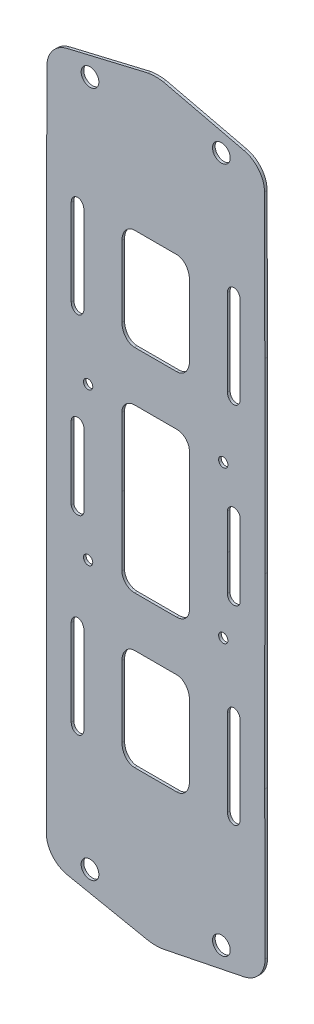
ISO-10303-21;
HEADER;
FILE_DESCRIPTION(('STEP AP214'),'2;1');
FILE_NAME('part.step','',(''),(''),'','','');
FILE_SCHEMA(('AUTOMOTIVE_DESIGN { 1 0 10303 214 1 1 1 1 }'));
ENDSEC;
DATA;
#1=APPLICATION_CONTEXT('core data for automotive mechanical design processes');
#2=APPLICATION_PROTOCOL_DEFINITION('international standard','automotive_design',2000,#1);
#3=PRODUCT_CONTEXT('',#1,'mechanical');
#4=PRODUCT('Part','Part','',(#3));
#5=PRODUCT_RELATED_PRODUCT_CATEGORY('part','',(#4));
#6=PRODUCT_DEFINITION_FORMATION('','',#4);
#7=PRODUCT_DEFINITION_CONTEXT('part definition',#1,'design');
#8=PRODUCT_DEFINITION('design','',#6,#7);
#9=PRODUCT_DEFINITION_SHAPE('','',#8);
#10=(LENGTH_UNIT() NAMED_UNIT(*) SI_UNIT(.MILLI.,.METRE.));
#11=(NAMED_UNIT(*) PLANE_ANGLE_UNIT() SI_UNIT($,.RADIAN.));
#12=(NAMED_UNIT(*) SI_UNIT($,.STERADIAN.) SOLID_ANGLE_UNIT());
#13=UNCERTAINTY_MEASURE_WITH_UNIT(LENGTH_MEASURE(1.E-05),#10,'distance_accuracy_value','');
#14=(GEOMETRIC_REPRESENTATION_CONTEXT(3) GLOBAL_UNCERTAINTY_ASSIGNED_CONTEXT((#13)) GLOBAL_UNIT_ASSIGNED_CONTEXT((#10,
#11,#12)) REPRESENTATION_CONTEXT('',''));
#15=CARTESIAN_POINT('',(0.,0.,0.));
#16=DIRECTION('',(0.,0.,1.));
#17=DIRECTION('',(1.,0.,0.));
#18=AXIS2_PLACEMENT_3D('',#15,#16,#17);
#19=CARTESIAN_POINT('',(15.6008487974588,62.6166574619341,0.5));
#20=DIRECTION('',(0.,0.,1.));
#21=DIRECTION('',(1.,0.,0.));
#22=AXIS2_PLACEMENT_3D('',#19,#20,#21);
#23=PLANE('',#22);
#24=CARTESIAN_POINT('',(-12.4370091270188,64.958952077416,0.5));
#25=DIRECTION('',(0.,0.,1.));
#26=DIRECTION('',(-1.,0.,0.));
#27=AXIS2_PLACEMENT_3D('',#24,#25,#26);
#28=CIRCLE('',#27,1.67999999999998);
#29=CARTESIAN_POINT('',(-14.1170091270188,64.958952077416,0.5));
#30=VERTEX_POINT('',#29);
#31=EDGE_CURVE('E1678',#30,#30,#28,.T.);
#32=ORIENTED_EDGE('',*,*,#31,.F.);
#33=EDGE_LOOP('',(#32));
#34=FACE_BOUND('',#33,.T.);
#35=CARTESIAN_POINT('',(-12.7919999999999,-14.4015625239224,0.5));
#36=DIRECTION('',(0.,0.,1.));
#37=DIRECTION('',(1.,0.,0.));
#38=AXIS2_PLACEMENT_3D('',#35,#36,#37);
#39=CIRCLE('',#38,0.880000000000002);
#40=CARTESIAN_POINT('',(-11.9119999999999,-14.4015625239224,0.5));
#41=VERTEX_POINT('',#40);
#42=EDGE_CURVE('E1690',#41,#41,#39,.T.);
#43=ORIENTED_EDGE('',*,*,#42,.F.);
#44=EDGE_LOOP('',(#43));
#45=FACE_BOUND('',#44,.T.);
#46=DIRECTION('',(0.,-1.,0.));
#47=VECTOR('',#46,1.);
#48=CARTESIAN_POINT('',(-15.9919999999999,42.6106285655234,0.5));
#49=LINE('',#48,#47);
#50=CARTESIAN_POINT('',(-15.9919999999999,42.6106285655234,0.5));
#51=VERTEX_POINT('',#50);
#52=CARTESIAN_POINT('',(-15.9919999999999,26.2906285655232,0.5));
#53=VERTEX_POINT('',#52);
#54=EDGE_CURVE('E527',#51,#53,#49,.T.);
#55=ORIENTED_EDGE('',*,*,#54,.F.);
#56=CARTESIAN_POINT('',(-14.7919999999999,42.6106285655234,0.5));
#57=DIRECTION('',(0.,0.,1.));
#58=DIRECTION('',(0.,-1.,0.));
#59=AXIS2_PLACEMENT_3D('',#56,#57,#58);
#60=ELLIPSE('',#59,1.44,1.2);
#61=CARTESIAN_POINT('',(-13.5919999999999,42.6106285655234,0.5));
#62=VERTEX_POINT('',#61);
#63=EDGE_CURVE('E542',#62,#51,#60,.T.);
#64=ORIENTED_EDGE('',*,*,#63,.F.);
#65=DIRECTION('',(0.,1.,0.));
#66=VECTOR('',#65,1.);
#67=CARTESIAN_POINT('',(-13.5919999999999,26.2906285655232,0.5));
#68=LINE('',#67,#66);
#69=CARTESIAN_POINT('',(-13.5919999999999,26.2906285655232,0.5));
#70=VERTEX_POINT('',#69);
#71=EDGE_CURVE('E526',#70,#62,#68,.T.);
#72=ORIENTED_EDGE('',*,*,#71,.F.);
#73=CARTESIAN_POINT('',(-14.7919999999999,26.2906285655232,0.5));
#74=DIRECTION('',(0.,0.,1.));
#75=DIRECTION('',(0.,-1.,0.));
#76=AXIS2_PLACEMENT_3D('',#73,#74,#75);
#77=ELLIPSE('',#76,1.44,1.2);
#78=EDGE_CURVE('E521',#53,#70,#77,.T.);
#79=ORIENTED_EDGE('',*,*,#78,.F.);
#80=EDGE_LOOP('',(#55,#64,#72,#79));
#81=FACE_BOUND('',#80,.T.);
#82=DIRECTION('',(0.,1.,0.));
#83=VECTOR('',#82,1.);
#84=CARTESIAN_POINT('',(6.39199999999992,41.1706285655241,0.5));
#85=LINE('',#84,#83);
#86=CARTESIAN_POINT('',(6.39199999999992,27.730628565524,0.5));
#87=VERTEX_POINT('',#86);
#88=CARTESIAN_POINT('',(6.39199999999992,41.1706285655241,0.5));
#89=VERTEX_POINT('',#88);
#90=EDGE_CURVE('E562',#87,#89,#85,.T.);
#91=ORIENTED_EDGE('',*,*,#90,.F.);
#92=CARTESIAN_POINT('',(3.99199999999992,27.730628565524,0.5));
#93=DIRECTION('',(0.,0.,1.));
#94=DIRECTION('',(0.,-1.,0.));
#95=AXIS2_PLACEMENT_3D('',#92,#93,#94);
#96=ELLIPSE('',#95,2.87999999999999,2.4);
#97=CARTESIAN_POINT('',(3.99199999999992,24.850628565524,0.5));
#98=VERTEX_POINT('',#97);
#99=EDGE_CURVE('E559',#98,#87,#96,.T.);
#100=ORIENTED_EDGE('',*,*,#99,.F.);
#101=DIRECTION('',(1.,0.,0.));
#102=VECTOR('',#101,1.);
#103=CARTESIAN_POINT('',(-3.99199999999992,24.850628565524,0.5));
#104=LINE('',#103,#102);
#105=CARTESIAN_POINT('',(-3.99199999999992,24.850628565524,0.5));
#106=VERTEX_POINT('',#105);
#107=EDGE_CURVE('E1906',#106,#98,#104,.T.);
#108=ORIENTED_EDGE('',*,*,#107,.F.);
#109=CARTESIAN_POINT('',(-3.99199999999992,27.730628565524,0.5));
#110=DIRECTION('',(0.,0.,1.));
#111=DIRECTION('',(0.,-1.,0.));
#112=AXIS2_PLACEMENT_3D('',#109,#110,#111);
#113=ELLIPSE('',#112,2.87999999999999,2.4);
#114=CARTESIAN_POINT('',(-6.39199999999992,27.730628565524,0.5));
#115=VERTEX_POINT('',#114);
#116=EDGE_CURVE('E1927',#115,#106,#113,.T.);
#117=ORIENTED_EDGE('',*,*,#116,.F.);
#118=DIRECTION('',(0.,-1.,0.));
#119=VECTOR('',#118,1.);
#120=CARTESIAN_POINT('',(-6.39199999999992,41.1706285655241,0.5));
#121=LINE('',#120,#119);
#122=CARTESIAN_POINT('',(-6.39199999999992,41.1706285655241,0.5));
#123=VERTEX_POINT('',#122);
#124=EDGE_CURVE('E1931',#123,#115,#121,.T.);
#125=ORIENTED_EDGE('',*,*,#124,.F.);
#126=CARTESIAN_POINT('',(-3.99199999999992,41.1706285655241,0.5));
#127=DIRECTION('',(0.,0.,1.));
#128=DIRECTION('',(0.,-1.,0.));
#129=AXIS2_PLACEMENT_3D('',#126,#127,#128);
#130=ELLIPSE('',#129,2.88000000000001,2.4);
#131=CARTESIAN_POINT('',(-3.99199999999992,44.0506285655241,0.5));
#132=VERTEX_POINT('',#131);
#133=EDGE_CURVE('E1933',#132,#123,#130,.T.);
#134=ORIENTED_EDGE('',*,*,#133,.F.);
#135=DIRECTION('',(-1.,0.,0.));
#136=VECTOR('',#135,1.);
#137=CARTESIAN_POINT('',(-3.99199999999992,44.0506285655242,0.5));
#138=LINE('',#137,#136);
#139=CARTESIAN_POINT('',(3.99199999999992,44.0506285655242,0.5));
#140=VERTEX_POINT('',#139);
#141=EDGE_CURVE('E1936',#140,#132,#138,.T.);
#142=ORIENTED_EDGE('',*,*,#141,.F.);
#143=CARTESIAN_POINT('',(3.99199999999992,41.1706285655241,0.5));
#144=DIRECTION('',(0.,0.,1.));
#145=DIRECTION('',(0.,-1.,0.));
#146=AXIS2_PLACEMENT_3D('',#143,#144,#145);
#147=ELLIPSE('',#146,2.88000000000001,2.4);
#148=EDGE_CURVE('E1937',#89,#140,#147,.T.);
#149=ORIENTED_EDGE('',*,*,#148,.F.);
#150=EDGE_LOOP('',(#91,#100,#108,#117,#125,#134,#142,#149));
#151=FACE_BOUND('',#150,.T.);
#152=DIRECTION('',(-1.,0.,0.));
#153=VECTOR('',#152,1.);
#154=CARTESIAN_POINT('',(-3.9920000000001,15.4015625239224,0.5));
#155=LINE('',#154,#153);
#156=CARTESIAN_POINT('',(3.9920000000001,15.4015625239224,0.5));
#157=VERTEX_POINT('',#156);
#158=CARTESIAN_POINT('',(-3.9920000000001,15.4015625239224,0.5));
#159=VERTEX_POINT('',#158);
#160=EDGE_CURVE('E1880',#157,#159,#155,.T.);
#161=ORIENTED_EDGE('',*,*,#160,.F.);
#162=CARTESIAN_POINT('',(3.9920000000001,13.0015625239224,0.5));
#163=DIRECTION('',(0.,0.,1.));
#164=DIRECTION('',(1.,0.,0.));
#165=AXIS2_PLACEMENT_3D('',#162,#163,#164);
#166=CIRCLE('',#165,2.4);
#167=CARTESIAN_POINT('',(6.3920000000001,13.0015625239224,0.5));
#168=VERTEX_POINT('',#167);
#169=EDGE_CURVE('E1838',#168,#157,#166,.T.);
#170=ORIENTED_EDGE('',*,*,#169,.F.);
#171=DIRECTION('',(0.,1.,0.));
#172=VECTOR('',#171,1.);
#173=CARTESIAN_POINT('',(6.3920000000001,13.0015625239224,0.5));
#174=LINE('',#173,#172);
#175=CARTESIAN_POINT('',(6.3920000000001,0.,0.5));
#176=VERTEX_POINT('',#175);
#177=EDGE_CURVE('E1835',#176,#168,#174,.T.);
#178=ORIENTED_EDGE('',*,*,#177,.F.);
#179=DIRECTION('',(-2.4149575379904E-05,0.999999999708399,0.));
#180=VECTOR('',#179,1.);
#181=CARTESIAN_POINT('',(6.3920000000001,0.,0.5));
#182=LINE('',#181,#180);
#183=CARTESIAN_POINT('',(6.392314,-13.002299,0.5));
#184=VERTEX_POINT('',#183);
#185=EDGE_CURVE('E1865',#184,#176,#182,.T.);
#186=ORIENTED_EDGE('',*,*,#185,.F.);
#187=CARTESIAN_POINT('',(3.9920000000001,-13.0015625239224,0.5));
#188=DIRECTION('',(0.,0.,1.));
#189=DIRECTION('',(-1.,0.,0.));
#190=AXIS2_PLACEMENT_3D('',#187,#188,#189);
#191=CIRCLE('',#190,2.4003141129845);
#192=CARTESIAN_POINT('',(3.95316907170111,-15.4015625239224,0.5));
#193=VERTEX_POINT('',#192);
#194=EDGE_CURVE('E1868',#193,#184,#191,.T.);
#195=ORIENTED_EDGE('',*,*,#194,.F.);
#196=DIRECTION('',(1.,0.,0.));
#197=VECTOR('',#196,1.);
#198=CARTESIAN_POINT('',(-3.9531690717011,-15.4015625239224,0.5));
#199=LINE('',#198,#197);
#200=CARTESIAN_POINT('',(-3.9531690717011,-15.4015625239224,0.5));
#201=VERTEX_POINT('',#200);
#202=EDGE_CURVE('E1870',#201,#193,#199,.T.);
#203=ORIENTED_EDGE('',*,*,#202,.F.);
#204=CARTESIAN_POINT('',(-3.9920000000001,-13.0015625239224,0.5));
#205=DIRECTION('',(0.,0.,1.));
#206=DIRECTION('',(1.,0.,0.));
#207=AXIS2_PLACEMENT_3D('',#204,#205,#206);
#208=CIRCLE('',#207,2.40031411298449);
#209=CARTESIAN_POINT('',(-6.392314,-13.002299,0.5));
#210=VERTEX_POINT('',#209);
#211=EDGE_CURVE('E1872',#210,#201,#208,.T.);
#212=ORIENTED_EDGE('',*,*,#211,.F.);
#213=DIRECTION('',(-2.41495753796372E-05,-0.999999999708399,0.));
#214=VECTOR('',#213,1.);
#215=CARTESIAN_POINT('',(-6.3920000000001,0.,0.5));
#216=LINE('',#215,#214);
#217=CARTESIAN_POINT('',(-6.3920000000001,0.,0.5));
#218=VERTEX_POINT('',#217);
#219=EDGE_CURVE('E1874',#218,#210,#216,.T.);
#220=ORIENTED_EDGE('',*,*,#219,.F.);
#221=DIRECTION('',(0.,-1.,0.));
#222=VECTOR('',#221,1.);
#223=CARTESIAN_POINT('',(-6.3920000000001,13.0015625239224,0.5));
#224=LINE('',#223,#222);
#225=CARTESIAN_POINT('',(-6.3920000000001,13.0015625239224,0.5));
#226=VERTEX_POINT('',#225);
#227=EDGE_CURVE('E1876',#226,#218,#224,.T.);
#228=ORIENTED_EDGE('',*,*,#227,.F.);
#229=CARTESIAN_POINT('',(-3.9920000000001,13.0015625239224,0.5));
#230=DIRECTION('',(0.,0.,1.));
#231=DIRECTION('',(-1.,0.,0.));
#232=AXIS2_PLACEMENT_3D('',#229,#230,#231);
#233=CIRCLE('',#232,2.4);
#234=EDGE_CURVE('E1878',#159,#226,#233,.T.);
#235=ORIENTED_EDGE('',*,*,#234,.F.);
#236=EDGE_LOOP('',(#161,#170,#178,#186,#195,#203,#212,#220,#228,#235));
#237=FACE_BOUND('',#236,.T.);
#238=CARTESIAN_POINT('',(12.4370091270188,64.958952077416,0.5));
#239=DIRECTION('',(0.,0.,1.));
#240=DIRECTION('',(1.,0.,0.));
#241=AXIS2_PLACEMENT_3D('',#238,#239,#240);
#242=CIRCLE('',#241,1.67999999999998);
#243=CARTESIAN_POINT('',(14.1170091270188,64.958952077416,0.5));
#244=VERTEX_POINT('',#243);
#245=EDGE_CURVE('E666',#244,#244,#242,.T.);
#246=ORIENTED_EDGE('',*,*,#245,.F.);
#247=EDGE_LOOP('',(#246));
#248=FACE_BOUND('',#247,.T.);
#249=CARTESIAN_POINT('',(14.7919999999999,-6.80156252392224,0.5));
#250=DIRECTION('',(0.,0.,1.));
#251=DIRECTION('',(-1.,0.,0.));
#252=AXIS2_PLACEMENT_3D('',#249,#250,#251);
#253=CIRCLE('',#252,1.21873491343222);
#254=CARTESIAN_POINT('',(13.575309,-6.731009,0.5));
#255=VERTEX_POINT('',#254);
#256=CARTESIAN_POINT('',(15.9919999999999,-7.0144352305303,0.5));
#257=VERTEX_POINT('',#256);
#258=EDGE_CURVE('E688',#255,#257,#253,.T.);
#259=ORIENTED_EDGE('',*,*,#258,.F.);
#260=DIRECTION('',(-0.00247970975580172,-0.999996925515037,0.));
#261=VECTOR('',#260,1.);
#262=CARTESIAN_POINT('',(13.5919999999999,0.,0.5));
#263=LINE('',#262,#261);
#264=CARTESIAN_POINT('',(13.5919999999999,0.,0.5));
#265=VERTEX_POINT('',#264);
#266=EDGE_CURVE('E686',#265,#255,#263,.T.);
#267=ORIENTED_EDGE('',*,*,#266,.F.);
#268=DIRECTION('',(0.,-1.,0.));
#269=VECTOR('',#268,1.);
#270=CARTESIAN_POINT('',(13.5919999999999,0.,0.5));
#271=LINE('',#270,#269);
#272=CARTESIAN_POINT('',(13.5919999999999,6.80156252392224,0.5));
#273=VERTEX_POINT('',#272);
#274=EDGE_CURVE('E696',#273,#265,#271,.T.);
#275=ORIENTED_EDGE('',*,*,#274,.F.);
#276=CARTESIAN_POINT('',(14.7919999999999,6.80156252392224,0.5));
#277=DIRECTION('',(0.,0.,1.));
#278=DIRECTION('',(1.,0.,0.));
#279=AXIS2_PLACEMENT_3D('',#276,#277,#278);
#280=CIRCLE('',#279,1.2);
#281=CARTESIAN_POINT('',(15.9919999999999,6.80156252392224,0.5));
#282=VERTEX_POINT('',#281);
#283=EDGE_CURVE('E693',#282,#273,#280,.T.);
#284=ORIENTED_EDGE('',*,*,#283,.F.);
#285=DIRECTION('',(0.,1.,0.));
#286=VECTOR('',#285,1.);
#287=CARTESIAN_POINT('',(15.9919999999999,0.,0.5));
#288=LINE('',#287,#286);
#289=EDGE_CURVE('E691',#257,#282,#288,.T.);
#290=ORIENTED_EDGE('',*,*,#289,.F.);
#291=EDGE_LOOP('',(#259,#267,#275,#284,#290));
#292=FACE_BOUND('',#291,.T.);
#293=DIRECTION('',(0.,1.,0.));
#294=VECTOR('',#293,1.);
#295=CARTESIAN_POINT('',(6.39199999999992,-41.1706285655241,0.5));
#296=LINE('',#295,#294);
#297=CARTESIAN_POINT('',(6.39199999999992,-41.1706285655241,0.5));
#298=VERTEX_POINT('',#297);
#299=CARTESIAN_POINT('',(6.39199999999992,-27.730628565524,0.5));
#300=VERTEX_POINT('',#299);
#301=EDGE_CURVE('E1722',#298,#300,#296,.T.);
#302=ORIENTED_EDGE('',*,*,#301,.F.);
#303=CARTESIAN_POINT('',(3.99199999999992,-41.1706285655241,0.5));
#304=DIRECTION('',(0.,0.,1.));
#305=DIRECTION('',(0.,1.,0.));
#306=AXIS2_PLACEMENT_3D('',#303,#304,#305);
#307=ELLIPSE('',#306,2.88000000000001,2.4);
#308=CARTESIAN_POINT('',(3.99199999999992,-44.0506285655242,0.5));
#309=VERTEX_POINT('',#308);
#310=EDGE_CURVE('E785',#309,#298,#307,.T.);
#311=ORIENTED_EDGE('',*,*,#310,.F.);
#312=DIRECTION('',(1.,0.,0.));
#313=VECTOR('',#312,1.);
#314=CARTESIAN_POINT('',(-3.99199999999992,-44.0506285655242,0.5));
#315=LINE('',#314,#313);
#316=CARTESIAN_POINT('',(-3.99199999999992,-44.0506285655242,0.5));
#317=VERTEX_POINT('',#316);
#318=EDGE_CURVE('E755',#317,#309,#315,.T.);
#319=ORIENTED_EDGE('',*,*,#318,.F.);
#320=CARTESIAN_POINT('',(-3.99199999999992,-41.1706285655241,0.5));
#321=DIRECTION('',(0.,0.,1.));
#322=DIRECTION('',(0.,1.,0.));
#323=AXIS2_PLACEMENT_3D('',#320,#321,#322);
#324=ELLIPSE('',#323,2.88000000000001,2.4);
#325=CARTESIAN_POINT('',(-6.39199999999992,-41.1706285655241,0.5));
#326=VERTEX_POINT('',#325);
#327=EDGE_CURVE('E750',#326,#317,#324,.T.);
#328=ORIENTED_EDGE('',*,*,#327,.F.);
#329=DIRECTION('',(0.,-1.,0.));
#330=VECTOR('',#329,1.);
#331=CARTESIAN_POINT('',(-6.39199999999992,-41.1706285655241,0.5));
#332=LINE('',#331,#330);
#333=CARTESIAN_POINT('',(-6.39199999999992,-27.730628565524,0.5));
#334=VERTEX_POINT('',#333);
#335=EDGE_CURVE('E756',#334,#326,#332,.T.);
#336=ORIENTED_EDGE('',*,*,#335,.F.);
#337=CARTESIAN_POINT('',(-3.99199999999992,-27.730628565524,0.5));
#338=DIRECTION('',(0.,0.,1.));
#339=DIRECTION('',(0.,1.,0.));
#340=AXIS2_PLACEMENT_3D('',#337,#338,#339);
#341=ELLIPSE('',#340,2.87999999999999,2.4);
#342=CARTESIAN_POINT('',(-3.99199999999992,-24.850628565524,0.5));
#343=VERTEX_POINT('',#342);
#344=EDGE_CURVE('E1733',#343,#334,#341,.T.);
#345=ORIENTED_EDGE('',*,*,#344,.F.);
#346=DIRECTION('',(-1.,0.,0.));
#347=VECTOR('',#346,1.);
#348=CARTESIAN_POINT('',(-3.99199999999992,-24.850628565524,0.5));
#349=LINE('',#348,#347);
#350=CARTESIAN_POINT('',(3.99199999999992,-24.850628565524,0.5));
#351=VERTEX_POINT('',#350);
#352=EDGE_CURVE('E1732',#351,#343,#349,.T.);
#353=ORIENTED_EDGE('',*,*,#352,.F.);
#354=CARTESIAN_POINT('',(3.99199999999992,-27.730628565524,0.5));
#355=DIRECTION('',(0.,0.,1.));
#356=DIRECTION('',(0.,1.,0.));
#357=AXIS2_PLACEMENT_3D('',#354,#355,#356);
#358=ELLIPSE('',#357,2.87999999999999,2.4);
#359=EDGE_CURVE('E1724',#300,#351,#358,.T.);
#360=ORIENTED_EDGE('',*,*,#359,.F.);
#361=EDGE_LOOP('',(#302,#311,#319,#328,#336,#345,#353,#360));
#362=FACE_BOUND('',#361,.T.);
#363=CARTESIAN_POINT('',(15.6008487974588,62.6166574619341,0.5));
#364=DIRECTION('',(0.,0.,1.));
#365=DIRECTION('',(1.,0.,0.));
#366=AXIS2_PLACEMENT_3D('',#363,#364,#365);
#367=CIRCLE('',#366,5.);
#368=CARTESIAN_POINT('',(20.6008386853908,62.626713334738,0.5));
#369=VERTEX_POINT('',#368);
#370=CARTESIAN_POINT('',(16.752763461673,67.4821577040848,0.5));
#371=VERTEX_POINT('',#370);
#372=EDGE_CURVE('E810',#369,#371,#367,.T.);
#373=ORIENTED_EDGE('',*,*,#372,.T.);
#374=DIRECTION('',(-0.973100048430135,0.23038293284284,0.));
#375=VECTOR('',#374,1.);
#376=CARTESIAN_POINT('',(1.43574764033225,71.1084847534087,0.5));
#377=LINE('',#376,#375);
#378=CARTESIAN_POINT('',(1.43574764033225,71.1084847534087,0.5));
#379=VERTEX_POINT('',#378);
#380=EDGE_CURVE('E813',#371,#379,#377,.T.);
#381=ORIENTED_EDGE('',*,*,#380,.T.);
#382=CARTESIAN_POINT('',(0.,62.4197937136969,0.5));
#383=DIRECTION('',(0.,0.,1.));
#384=DIRECTION('',(1.,0.,0.));
#385=AXIS2_PLACEMENT_3D('',#382,#383,#384);
#386=CIRCLE('',#385,8.80651595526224);
#387=CARTESIAN_POINT('',(-1.43574764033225,71.1084847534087,0.5));
#388=VERTEX_POINT('',#387);
#389=EDGE_CURVE('E816',#379,#388,#386,.T.);
#390=ORIENTED_EDGE('',*,*,#389,.T.);
#391=DIRECTION('',(-0.973100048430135,-0.23038293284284,0.));
#392=VECTOR('',#391,1.);
#393=CARTESIAN_POINT('',(-1.43574764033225,71.1084847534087,0.5));
#394=LINE('',#393,#392);
#395=CARTESIAN_POINT('',(-16.752763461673,67.4821577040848,0.5));
#396=VERTEX_POINT('',#395);
#397=EDGE_CURVE('E818',#388,#396,#394,.T.);
#398=ORIENTED_EDGE('',*,*,#397,.T.);
#399=CARTESIAN_POINT('',(-15.6008487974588,62.6166574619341,0.5));
#400=DIRECTION('',(0.,0.,1.));
#401=DIRECTION('',(-1.,0.,0.));
#402=AXIS2_PLACEMENT_3D('',#399,#400,#401);
#403=CIRCLE('',#402,5.);
#404=CARTESIAN_POINT('',(-20.6008386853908,62.626713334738,0.5));
#405=VERTEX_POINT('',#404);
#406=EDGE_CURVE('E820',#396,#405,#403,.T.);
#407=ORIENTED_EDGE('',*,*,#406,.T.);
#408=DIRECTION('',(-0.00201117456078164,-0.999997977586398,0.));
#409=VECTOR('',#408,1.);
#410=CARTESIAN_POINT('',(-20.6557947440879,35.3014136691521,0.5));
#411=LINE('',#410,#409);
#412=CARTESIAN_POINT('',(-20.6557947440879,35.3014136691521,0.5));
#413=VERTEX_POINT('',#412);
#414=EDGE_CURVE('E822',#405,#413,#411,.T.);
#415=ORIENTED_EDGE('',*,*,#414,.T.);
#416=DIRECTION('',(0.,-1.,0.));
#417=VECTOR('',#416,1.);
#418=CARTESIAN_POINT('',(-20.6557947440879,35.3014136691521,0.5));
#419=LINE('',#418,#417);
#420=CARTESIAN_POINT('',(-20.6557947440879,0.,0.5));
#421=VERTEX_POINT('',#420);
#422=EDGE_CURVE('E824',#413,#421,#419,.T.);
#423=ORIENTED_EDGE('',*,*,#422,.T.);
#424=DIRECTION('',(0.000497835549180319,-0.999999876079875,0.));
#425=VECTOR('',#424,1.);
#426=CARTESIAN_POINT('',(-20.6557947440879,0.,0.5));
#427=LINE('',#426,#425);
#428=CARTESIAN_POINT('',(-20.6382378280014,-35.2664930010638,0.5));
#429=VERTEX_POINT('',#428);
#430=EDGE_CURVE('E826',#421,#429,#427,.T.);
#431=ORIENTED_EDGE('',*,*,#430,.T.);
#432=DIRECTION('',(-0.00244311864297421,-0.999997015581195,0.));
#433=VECTOR('',#432,1.);
#434=CARTESIAN_POINT('',(-20.6382378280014,-35.2664930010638,0.5));
#435=LINE('',#434,#433);
#436=CARTESIAN_POINT('',(-20.7062405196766,-63.1007895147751,0.5));
#437=VERTEX_POINT('',#436);
#438=EDGE_CURVE('E828',#429,#437,#435,.T.);
#439=ORIENTED_EDGE('',*,*,#438,.T.);
#440=CARTESIAN_POINT('',(-15.7062554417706,-63.11300510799,0.5));
#441=DIRECTION('',(0.,0.,1.));
#442=DIRECTION('',(1.,0.,0.));
#443=AXIS2_PLACEMENT_3D('',#440,#441,#442);
#444=CIRCLE('',#443,5.00000000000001);
#445=CARTESIAN_POINT('',(-16.6992020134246,-68.0134190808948,0.5));
#446=VERTEX_POINT('',#445);
#447=EDGE_CURVE('E830',#437,#446,#444,.T.);
#448=ORIENTED_EDGE('',*,*,#447,.T.);
#449=DIRECTION('',(0.980082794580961,-0.19858931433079,0.));
#450=VECTOR('',#449,1.);
#451=CARTESIAN_POINT('',(-1.34617955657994,-71.1243258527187,0.5));
#452=LINE('',#451,#450);
#453=CARTESIAN_POINT('',(-1.34617955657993,-71.1243258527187,0.5));
#454=VERTEX_POINT('',#453);
#455=EDGE_CURVE('E832',#446,#454,#452,.T.);
#456=ORIENTED_EDGE('',*,*,#455,.T.);
#457=CARTESIAN_POINT('',(0.,-62.4197937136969,0.5));
#458=DIRECTION('',(0.,0.,1.));
#459=DIRECTION('',(1.,0.,0.));
#460=AXIS2_PLACEMENT_3D('',#457,#458,#459);
#461=CIRCLE('',#460,8.80801221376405);
#462=CARTESIAN_POINT('',(1.34617955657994,-71.1243258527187,0.5));
#463=VERTEX_POINT('',#462);
#464=EDGE_CURVE('E834',#454,#463,#461,.T.);
#465=ORIENTED_EDGE('',*,*,#464,.T.);
#466=DIRECTION('',(0.980082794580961,0.198589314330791,0.));
#467=VECTOR('',#466,1.);
#468=CARTESIAN_POINT('',(1.34617955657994,-71.1243258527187,0.5));
#469=LINE('',#468,#467);
#470=CARTESIAN_POINT('',(16.6992020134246,-68.0134190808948,0.5));
#471=VERTEX_POINT('',#470);
#472=EDGE_CURVE('E836',#463,#471,#469,.T.);
#473=ORIENTED_EDGE('',*,*,#472,.T.);
#474=CARTESIAN_POINT('',(15.7062554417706,-63.11300510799,0.5));
#475=DIRECTION('',(0.,0.,1.));
#476=DIRECTION('',(-1.,0.,0.));
#477=AXIS2_PLACEMENT_3D('',#474,#475,#476);
#478=CIRCLE('',#477,5.);
#479=CARTESIAN_POINT('',(20.7062405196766,-63.1007895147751,0.5));
#480=VERTEX_POINT('',#479);
#481=EDGE_CURVE('E838',#471,#480,#478,.T.);
#482=ORIENTED_EDGE('',*,*,#481,.T.);
#483=DIRECTION('',(-0.00244311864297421,0.999997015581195,0.));
#484=VECTOR('',#483,1.);
#485=CARTESIAN_POINT('',(20.6382378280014,-35.2664930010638,0.5));
#486=LINE('',#485,#484);
#487=CARTESIAN_POINT('',(20.6382378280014,-35.2664930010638,0.5));
#488=VERTEX_POINT('',#487);
#489=EDGE_CURVE('E840',#480,#488,#486,.T.);
#490=ORIENTED_EDGE('',*,*,#489,.T.);
#491=DIRECTION('',(0.000497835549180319,0.999999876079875,0.));
#492=VECTOR('',#491,1.);
#493=CARTESIAN_POINT('',(20.6557947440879,0.,0.5));
#494=LINE('',#493,#492);
#495=CARTESIAN_POINT('',(20.6557947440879,0.,0.5));
#496=VERTEX_POINT('',#495);
#497=EDGE_CURVE('E842',#488,#496,#494,.T.);
#498=ORIENTED_EDGE('',*,*,#497,.T.);
#499=DIRECTION('',(0.,1.,0.));
#500=VECTOR('',#499,1.);
#501=CARTESIAN_POINT('',(20.6557947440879,35.3014136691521,0.5));
#502=LINE('',#501,#500);
#503=CARTESIAN_POINT('',(20.6557947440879,35.3014136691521,0.5));
#504=VERTEX_POINT('',#503);
#505=EDGE_CURVE('E844',#496,#504,#502,.T.);
#506=ORIENTED_EDGE('',*,*,#505,.T.);
#507=DIRECTION('',(-0.00201117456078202,0.999997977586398,0.));
#508=VECTOR('',#507,1.);
#509=CARTESIAN_POINT('',(20.6557947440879,35.3014136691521,0.5));
#510=LINE('',#509,#508);
#511=EDGE_CURVE('E846',#504,#369,#510,.T.);
#512=ORIENTED_EDGE('',*,*,#511,.T.);
#513=EDGE_LOOP('',(#373,#381,#390,#398,#407,#415,#423,#431,#439,#448,#456,#465,#473,#482,#490,
#498,#506,#512));
#514=FACE_BOUND('',#513,.T.);
#515=CARTESIAN_POINT('',(12.7919999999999,14.4015625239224,0.5));
#516=DIRECTION('',(0.,0.,1.));
#517=DIRECTION('',(1.,0.,0.));
#518=AXIS2_PLACEMENT_3D('',#515,#516,#517);
#519=CIRCLE('',#518,0.880000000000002);
#520=CARTESIAN_POINT('',(13.6719999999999,14.4015625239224,0.5));
#521=VERTEX_POINT('',#520);
#522=EDGE_CURVE('E804',#521,#521,#519,.T.);
#523=ORIENTED_EDGE('',*,*,#522,.F.);
#524=EDGE_LOOP('',(#523));
#525=FACE_BOUND('',#524,.T.);
#526=DIRECTION('',(0.,1.,0.));
#527=VECTOR('',#526,1.);
#528=CARTESIAN_POINT('',(15.9919999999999,-42.6106285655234,0.5));
#529=LINE('',#528,#527);
#530=CARTESIAN_POINT('',(15.9919999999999,-42.6106285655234,0.5));
#531=VERTEX_POINT('',#530);
#532=CARTESIAN_POINT('',(15.9919999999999,-26.2906285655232,0.5));
#533=VERTEX_POINT('',#532);
#534=EDGE_CURVE('E728',#531,#533,#529,.T.);
#535=ORIENTED_EDGE('',*,*,#534,.F.);
#536=CARTESIAN_POINT('',(14.7919999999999,-42.6106285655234,0.5));
#537=DIRECTION('',(0.,0.,1.));
#538=DIRECTION('',(0.,1.,0.));
#539=AXIS2_PLACEMENT_3D('',#536,#537,#538);
#540=ELLIPSE('',#539,1.44,1.2);
#541=CARTESIAN_POINT('',(13.5919999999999,-42.6106285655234,0.5));
#542=VERTEX_POINT('',#541);
#543=EDGE_CURVE('E725',#542,#531,#540,.T.);
#544=ORIENTED_EDGE('',*,*,#543,.F.);
#545=DIRECTION('',(0.,-1.,0.));
#546=VECTOR('',#545,1.);
#547=CARTESIAN_POINT('',(13.5919999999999,-26.2906285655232,0.5));
#548=LINE('',#547,#546);
#549=CARTESIAN_POINT('',(13.5919999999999,-26.2906285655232,0.5));
#550=VERTEX_POINT('',#549);
#551=EDGE_CURVE('E1755',#550,#542,#548,.T.);
#552=ORIENTED_EDGE('',*,*,#551,.F.);
#553=CARTESIAN_POINT('',(14.7919999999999,-26.2906285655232,0.5));
#554=DIRECTION('',(0.,0.,1.));
#555=DIRECTION('',(0.,1.,0.));
#556=AXIS2_PLACEMENT_3D('',#553,#554,#555);
#557=ELLIPSE('',#556,1.44,1.2);
#558=EDGE_CURVE('E1766',#533,#550,#557,.T.);
#559=ORIENTED_EDGE('',*,*,#558,.F.);
#560=EDGE_LOOP('',(#535,#544,#552,#559));
#561=FACE_BOUND('',#560,.T.);
#562=DIRECTION('',(0.,1.,0.));
#563=VECTOR('',#562,1.);
#564=CARTESIAN_POINT('',(15.9919999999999,42.6106285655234,0.5));
#565=LINE('',#564,#563);
#566=CARTESIAN_POINT('',(15.9919999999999,26.2906285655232,0.5));
#567=VERTEX_POINT('',#566);
#568=CARTESIAN_POINT('',(15.9919999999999,42.6106285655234,0.5));
#569=VERTEX_POINT('',#568);
#570=EDGE_CURVE('E658',#567,#569,#565,.T.);
#571=ORIENTED_EDGE('',*,*,#570,.F.);
#572=CARTESIAN_POINT('',(14.7919999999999,26.2906285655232,0.5));
#573=DIRECTION('',(0.,0.,1.));
#574=DIRECTION('',(0.,-1.,0.));
#575=AXIS2_PLACEMENT_3D('',#572,#573,#574);
#576=ELLIPSE('',#575,1.44,1.2);
#577=CARTESIAN_POINT('',(13.5919999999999,26.2906285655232,0.5));
#578=VERTEX_POINT('',#577);
#579=EDGE_CURVE('E675',#578,#567,#576,.T.);
#580=ORIENTED_EDGE('',*,*,#579,.F.);
#581=DIRECTION('',(0.,-1.,0.));
#582=VECTOR('',#581,1.);
#583=CARTESIAN_POINT('',(13.5919999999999,26.2906285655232,0.5));
#584=LINE('',#583,#582);
#585=CARTESIAN_POINT('',(13.5919999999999,42.6106285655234,0.5));
#586=VERTEX_POINT('',#585);
#587=EDGE_CURVE('E657',#586,#578,#584,.T.);
#588=ORIENTED_EDGE('',*,*,#587,.F.);
#589=CARTESIAN_POINT('',(14.7919999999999,42.6106285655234,0.5));
#590=DIRECTION('',(0.,0.,1.));
#591=DIRECTION('',(0.,-1.,0.));
#592=AXIS2_PLACEMENT_3D('',#589,#590,#591);
#593=ELLIPSE('',#592,1.44,1.2);
#594=EDGE_CURVE('E652',#569,#586,#593,.T.);
#595=ORIENTED_EDGE('',*,*,#594,.F.);
#596=EDGE_LOOP('',(#571,#580,#588,#595));
#597=FACE_BOUND('',#596,.T.);
#598=CARTESIAN_POINT('',(-14.7919999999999,6.80156252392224,0.5));
#599=DIRECTION('',(0.,0.,1.));
#600=DIRECTION('',(-1.,0.,0.));
#601=AXIS2_PLACEMENT_3D('',#598,#599,#600);
#602=CIRCLE('',#601,1.2);
#603=CARTESIAN_POINT('',(-13.5919999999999,6.80156252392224,0.5));
#604=VERTEX_POINT('',#603);
#605=CARTESIAN_POINT('',(-15.9919999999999,6.80156252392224,0.5));
#606=VERTEX_POINT('',#605);
#607=EDGE_CURVE('E1811',#604,#606,#602,.T.);
#608=ORIENTED_EDGE('',*,*,#607,.F.);
#609=DIRECTION('',(0.,1.,0.));
#610=VECTOR('',#609,1.);
#611=CARTESIAN_POINT('',(-13.5919999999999,0.,0.5));
#612=LINE('',#611,#610);
#613=CARTESIAN_POINT('',(-13.5919999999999,0.,0.5));
#614=VERTEX_POINT('',#613);
#615=EDGE_CURVE('E1791',#614,#604,#612,.T.);
#616=ORIENTED_EDGE('',*,*,#615,.F.);
#617=DIRECTION('',(-0.00247970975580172,0.999996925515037,0.));
#618=VECTOR('',#617,1.);
#619=CARTESIAN_POINT('',(-13.5919999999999,0.,0.5));
#620=LINE('',#619,#618);
#621=CARTESIAN_POINT('',(-13.575309,-6.731009,0.5));
#622=VERTEX_POINT('',#621);
#623=EDGE_CURVE('E1787',#622,#614,#620,.T.);
#624=ORIENTED_EDGE('',*,*,#623,.F.);
#625=CARTESIAN_POINT('',(-14.7919999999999,-6.80156252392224,0.5));
#626=DIRECTION('',(0.,0.,1.));
#627=DIRECTION('',(1.,0.,0.));
#628=AXIS2_PLACEMENT_3D('',#625,#626,#627);
#629=CIRCLE('',#628,1.21873491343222);
#630=CARTESIAN_POINT('',(-15.9919999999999,-7.01443523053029,0.5));
#631=VERTEX_POINT('',#630);
#632=EDGE_CURVE('E1806',#631,#622,#629,.T.);
#633=ORIENTED_EDGE('',*,*,#632,.F.);
#634=DIRECTION('',(0.,-1.,0.));
#635=VECTOR('',#634,1.);
#636=CARTESIAN_POINT('',(-15.9919999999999,6.80156252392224,0.5));
#637=LINE('',#636,#635);
#638=EDGE_CURVE('E1809',#606,#631,#637,.T.);
#639=ORIENTED_EDGE('',*,*,#638,.F.);
#640=EDGE_LOOP('',(#608,#616,#624,#633,#639));
#641=FACE_BOUND('',#640,.T.);
#642=CARTESIAN_POINT('',(12.4370091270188,-64.958952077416,0.5));
#643=DIRECTION('',(0.,0.,1.));
#644=DIRECTION('',(-1.,0.,0.));
#645=AXIS2_PLACEMENT_3D('',#642,#643,#644);
#646=CIRCLE('',#645,1.67999999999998);
#647=CARTESIAN_POINT('',(10.7570091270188,-64.958952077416,0.5));
#648=VERTEX_POINT('',#647);
#649=EDGE_CURVE('E1863',#648,#648,#646,.T.);
#650=ORIENTED_EDGE('',*,*,#649,.F.);
#651=EDGE_LOOP('',(#650));
#652=FACE_BOUND('',#651,.T.);
#653=CARTESIAN_POINT('',(12.7919999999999,-14.4015625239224,0.5));
#654=DIRECTION('',(0.,0.,1.));
#655=DIRECTION('',(-1.,0.,0.));
#656=AXIS2_PLACEMENT_3D('',#653,#654,#655);
#657=CIRCLE('',#656,0.880000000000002);
#658=CARTESIAN_POINT('',(11.9119999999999,-14.4015625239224,0.5));
#659=VERTEX_POINT('',#658);
#660=EDGE_CURVE('E553',#659,#659,#657,.T.);
#661=ORIENTED_EDGE('',*,*,#660,.F.);
#662=EDGE_LOOP('',(#661));
#663=FACE_BOUND('',#662,.T.);
#664=DIRECTION('',(0.,-1.,0.));
#665=VECTOR('',#664,1.);
#666=CARTESIAN_POINT('',(-15.9919999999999,-42.6106285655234,0.5));
#667=LINE('',#666,#665);
#668=CARTESIAN_POINT('',(-15.9919999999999,-26.2906285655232,0.5));
#669=VERTEX_POINT('',#668);
#670=CARTESIAN_POINT('',(-15.9919999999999,-42.6106285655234,0.5));
#671=VERTEX_POINT('',#670);
#672=EDGE_CURVE('E476',#669,#671,#667,.T.);
#673=ORIENTED_EDGE('',*,*,#672,.F.);
#674=CARTESIAN_POINT('',(-14.7919999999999,-26.2906285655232,0.5));
#675=DIRECTION('',(0.,0.,1.));
#676=DIRECTION('',(0.,1.,0.));
#677=AXIS2_PLACEMENT_3D('',#674,#675,#676);
#678=ELLIPSE('',#677,1.44,1.2);
#679=CARTESIAN_POINT('',(-13.5919999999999,-26.2906285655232,0.5));
#680=VERTEX_POINT('',#679);
#681=EDGE_CURVE('E468',#680,#669,#678,.T.);
#682=ORIENTED_EDGE('',*,*,#681,.F.);
#683=DIRECTION('',(0.,1.,0.));
#684=VECTOR('',#683,1.);
#685=CARTESIAN_POINT('',(-13.5919999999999,-26.2906285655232,0.5));
#686=LINE('',#685,#684);
#687=CARTESIAN_POINT('',(-13.5919999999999,-42.6106285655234,0.5));
#688=VERTEX_POINT('',#687);
#689=EDGE_CURVE('E491',#688,#680,#686,.T.);
#690=ORIENTED_EDGE('',*,*,#689,.F.);
#691=CARTESIAN_POINT('',(-14.7919999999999,-42.6106285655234,0.5));
#692=DIRECTION('',(0.,0.,1.));
#693=DIRECTION('',(0.,1.,0.));
#694=AXIS2_PLACEMENT_3D('',#691,#692,#693);
#695=ELLIPSE('',#694,1.44,1.2);
#696=EDGE_CURVE('E489',#671,#688,#695,.T.);
#697=ORIENTED_EDGE('',*,*,#696,.F.);
#698=EDGE_LOOP('',(#673,#682,#690,#697));
#699=FACE_BOUND('',#698,.T.);
#700=CARTESIAN_POINT('',(-12.4370091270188,-64.958952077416,0.5));
#701=DIRECTION('',(0.,0.,1.));
#702=DIRECTION('',(1.,0.,0.));
#703=AXIS2_PLACEMENT_3D('',#700,#701,#702);
#704=CIRCLE('',#703,1.67999999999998);
#705=CARTESIAN_POINT('',(-10.7570091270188,-64.958952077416,0.5));
#706=VERTEX_POINT('',#705);
#707=EDGE_CURVE('E1684',#706,#706,#704,.T.);
#708=ORIENTED_EDGE('',*,*,#707,.F.);
#709=EDGE_LOOP('',(#708));
#710=FACE_BOUND('',#709,.T.);
#711=CARTESIAN_POINT('',(-12.7919999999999,14.4015625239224,0.5));
#712=DIRECTION('',(0.,0.,1.));
#713=DIRECTION('',(-1.,0.,0.));
#714=AXIS2_PLACEMENT_3D('',#711,#712,#713);
#715=CIRCLE('',#714,0.880000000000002);
#716=CARTESIAN_POINT('',(-13.6719999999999,14.4015625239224,0.5));
#717=VERTEX_POINT('',#716);
#718=EDGE_CURVE('E1669',#717,#717,#715,.T.);
#719=ORIENTED_EDGE('',*,*,#718,.F.);
#720=EDGE_LOOP('',(#719));
#721=FACE_BOUND('',#720,.T.);
#722=ADVANCED_FACE('F31',(#34,#45,#81,#151,#237,#248,#292,#362,#514,#525,#561,#597,#641,#652,
#663,#699,#710,#721),#23,.T.);
#723=CARTESIAN_POINT('',(15.6008487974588,62.6166574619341,0.));
#724=DIRECTION('',(0.,0.,1.));
#725=DIRECTION('',(1.,0.,0.));
#726=AXIS2_PLACEMENT_3D('',#723,#724,#725);
#727=PLANE('',#726);
#728=CARTESIAN_POINT('',(-12.4370091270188,64.958952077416,0.));
#729=DIRECTION('',(0.,0.,1.));
#730=DIRECTION('',(-1.,0.,0.));
#731=AXIS2_PLACEMENT_3D('',#728,#729,#730);
#732=CIRCLE('',#731,1.67999999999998);
#733=CARTESIAN_POINT('',(-14.1170091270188,64.958952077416,0.));
#734=VERTEX_POINT('',#733);
#735=EDGE_CURVE('E1675',#734,#734,#732,.T.);
#736=ORIENTED_EDGE('',*,*,#735,.T.);
#737=EDGE_LOOP('',(#736));
#738=FACE_BOUND('',#737,.T.);
#739=CARTESIAN_POINT('',(-12.7919999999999,-14.4015625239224,0.));
#740=DIRECTION('',(0.,0.,1.));
#741=DIRECTION('',(1.,0.,0.));
#742=AXIS2_PLACEMENT_3D('',#739,#740,#741);
#743=CIRCLE('',#742,0.880000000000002);
#744=CARTESIAN_POINT('',(-11.9119999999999,-14.4015625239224,0.));
#745=VERTEX_POINT('',#744);
#746=EDGE_CURVE('E1687',#745,#745,#743,.T.);
#747=ORIENTED_EDGE('',*,*,#746,.T.);
#748=EDGE_LOOP('',(#747));
#749=FACE_BOUND('',#748,.T.);
#750=CARTESIAN_POINT('',(-14.7919999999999,42.6106285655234,0.));
#751=DIRECTION('',(0.,0.,1.));
#752=DIRECTION('',(0.,-1.,0.));
#753=AXIS2_PLACEMENT_3D('',#750,#751,#752);
#754=ELLIPSE('',#753,1.44,1.2);
#755=CARTESIAN_POINT('',(-13.5919999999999,42.6106285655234,0.));
#756=VERTEX_POINT('',#755);
#757=CARTESIAN_POINT('',(-15.9919999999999,42.6106285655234,0.));
#758=VERTEX_POINT('',#757);
#759=EDGE_CURVE('E484',#756,#758,#754,.T.);
#760=ORIENTED_EDGE('',*,*,#759,.T.);
#761=DIRECTION('',(0.,-1.,0.));
#762=VECTOR('',#761,1.);
#763=CARTESIAN_POINT('',(-15.9919999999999,42.6106285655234,0.));
#764=LINE('',#763,#762);
#765=CARTESIAN_POINT('',(-15.9919999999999,26.2906285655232,0.));
#766=VERTEX_POINT('',#765);
#767=EDGE_CURVE('E533',#758,#766,#764,.T.);
#768=ORIENTED_EDGE('',*,*,#767,.T.);
#769=CARTESIAN_POINT('',(-14.7919999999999,26.2906285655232,0.));
#770=DIRECTION('',(0.,0.,1.));
#771=DIRECTION('',(0.,-1.,0.));
#772=AXIS2_PLACEMENT_3D('',#769,#770,#771);
#773=ELLIPSE('',#772,1.44,1.2);
#774=CARTESIAN_POINT('',(-13.5919999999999,26.2906285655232,0.));
#775=VERTEX_POINT('',#774);
#776=EDGE_CURVE('E536',#766,#775,#773,.T.);
#777=ORIENTED_EDGE('',*,*,#776,.T.);
#778=DIRECTION('',(0.,1.,0.));
#779=VECTOR('',#778,1.);
#780=CARTESIAN_POINT('',(-13.5919999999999,26.2906285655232,0.));
#781=LINE('',#780,#779);
#782=EDGE_CURVE('E539',#775,#756,#781,.T.);
#783=ORIENTED_EDGE('',*,*,#782,.T.);
#784=EDGE_LOOP('',(#760,#768,#777,#783));
#785=FACE_BOUND('',#784,.T.);
#786=CARTESIAN_POINT('',(3.99199999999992,27.730628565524,0.));
#787=DIRECTION('',(0.,0.,1.));
#788=DIRECTION('',(0.,-1.,0.));
#789=AXIS2_PLACEMENT_3D('',#786,#787,#788);
#790=ELLIPSE('',#789,2.87999999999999,2.4);
#791=CARTESIAN_POINT('',(3.99199999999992,24.850628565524,0.));
#792=VERTEX_POINT('',#791);
#793=CARTESIAN_POINT('',(6.39199999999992,27.730628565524,0.));
#794=VERTEX_POINT('',#793);
#795=EDGE_CURVE('E556',#792,#794,#790,.T.);
#796=ORIENTED_EDGE('',*,*,#795,.T.);
#797=DIRECTION('',(0.,1.,0.));
#798=VECTOR('',#797,1.);
#799=CARTESIAN_POINT('',(6.39199999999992,41.1706285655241,0.));
#800=LINE('',#799,#798);
#801=CARTESIAN_POINT('',(6.39199999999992,41.1706285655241,0.));
#802=VERTEX_POINT('',#801);
#803=EDGE_CURVE('E1923',#794,#802,#800,.T.);
#804=ORIENTED_EDGE('',*,*,#803,.T.);
#805=CARTESIAN_POINT('',(3.99199999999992,41.1706285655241,0.));
#806=DIRECTION('',(0.,0.,1.));
#807=DIRECTION('',(0.,-1.,0.));
#808=AXIS2_PLACEMENT_3D('',#805,#806,#807);
#809=ELLIPSE('',#808,2.88000000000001,2.4);
#810=CARTESIAN_POINT('',(3.99199999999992,44.0506285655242,0.));
#811=VERTEX_POINT('',#810);
#812=EDGE_CURVE('E1920',#802,#811,#809,.T.);
#813=ORIENTED_EDGE('',*,*,#812,.T.);
#814=DIRECTION('',(-1.,0.,0.));
#815=VECTOR('',#814,1.);
#816=CARTESIAN_POINT('',(-3.99199999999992,44.0506285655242,0.));
#817=LINE('',#816,#815);
#818=CARTESIAN_POINT('',(-3.99199999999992,44.0506285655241,0.));
#819=VERTEX_POINT('',#818);
#820=EDGE_CURVE('E1917',#811,#819,#817,.T.);
#821=ORIENTED_EDGE('',*,*,#820,.T.);
#822=CARTESIAN_POINT('',(-3.99199999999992,41.1706285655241,0.));
#823=DIRECTION('',(0.,0.,1.));
#824=DIRECTION('',(0.,-1.,0.));
#825=AXIS2_PLACEMENT_3D('',#822,#823,#824);
#826=ELLIPSE('',#825,2.88000000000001,2.4);
#827=CARTESIAN_POINT('',(-6.39199999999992,41.1706285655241,0.));
#828=VERTEX_POINT('',#827);
#829=EDGE_CURVE('E1914',#819,#828,#826,.T.);
#830=ORIENTED_EDGE('',*,*,#829,.T.);
#831=DIRECTION('',(0.,-1.,0.));
#832=VECTOR('',#831,1.);
#833=CARTESIAN_POINT('',(-6.39199999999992,41.1706285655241,0.));
#834=LINE('',#833,#832);
#835=CARTESIAN_POINT('',(-6.39199999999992,27.730628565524,0.));
#836=VERTEX_POINT('',#835);
#837=EDGE_CURVE('E1911',#828,#836,#834,.T.);
#838=ORIENTED_EDGE('',*,*,#837,.T.);
#839=CARTESIAN_POINT('',(-3.99199999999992,27.730628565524,0.));
#840=DIRECTION('',(0.,0.,1.));
#841=DIRECTION('',(0.,-1.,0.));
#842=AXIS2_PLACEMENT_3D('',#839,#840,#841);
#843=ELLIPSE('',#842,2.87999999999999,2.4);
#844=CARTESIAN_POINT('',(-3.99199999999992,24.850628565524,0.));
#845=VERTEX_POINT('',#844);
#846=EDGE_CURVE('E1908',#836,#845,#843,.T.);
#847=ORIENTED_EDGE('',*,*,#846,.T.);
#848=DIRECTION('',(1.,0.,0.));
#849=VECTOR('',#848,1.);
#850=CARTESIAN_POINT('',(-3.99199999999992,24.850628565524,0.));
#851=LINE('',#850,#849);
#852=EDGE_CURVE('E563',#845,#792,#851,.T.);
#853=ORIENTED_EDGE('',*,*,#852,.T.);
#854=EDGE_LOOP('',(#796,#804,#813,#821,#830,#838,#847,#853));
#855=FACE_BOUND('',#854,.T.);
#856=CARTESIAN_POINT('',(3.9920000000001,13.0015625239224,0.));
#857=DIRECTION('',(0.,0.,1.));
#858=DIRECTION('',(1.,0.,0.));
#859=AXIS2_PLACEMENT_3D('',#856,#857,#858);
#860=CIRCLE('',#859,2.4);
#861=CARTESIAN_POINT('',(6.3920000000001,13.0015625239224,0.));
#862=VERTEX_POINT('',#861);
#863=CARTESIAN_POINT('',(3.9920000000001,15.4015625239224,0.));
#864=VERTEX_POINT('',#863);
#865=EDGE_CURVE('E1706',#862,#864,#860,.T.);
#866=ORIENTED_EDGE('',*,*,#865,.T.);
#867=DIRECTION('',(-1.,0.,0.));
#868=VECTOR('',#867,1.);
#869=CARTESIAN_POINT('',(-3.9920000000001,15.4015625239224,0.));
#870=LINE('',#869,#868);
#871=CARTESIAN_POINT('',(-3.9920000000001,15.4015625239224,0.));
#872=VERTEX_POINT('',#871);
#873=EDGE_CURVE('E1860',#864,#872,#870,.T.);
#874=ORIENTED_EDGE('',*,*,#873,.T.);
#875=CARTESIAN_POINT('',(-3.9920000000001,13.0015625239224,0.));
#876=DIRECTION('',(0.,0.,1.));
#877=DIRECTION('',(-1.,0.,0.));
#878=AXIS2_PLACEMENT_3D('',#875,#876,#877);
#879=CIRCLE('',#878,2.4);
#880=CARTESIAN_POINT('',(-6.3920000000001,13.0015625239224,0.));
#881=VERTEX_POINT('',#880);
#882=EDGE_CURVE('E1857',#872,#881,#879,.T.);
#883=ORIENTED_EDGE('',*,*,#882,.T.);
#884=DIRECTION('',(0.,-1.,0.));
#885=VECTOR('',#884,1.);
#886=CARTESIAN_POINT('',(-6.3920000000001,13.0015625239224,0.));
#887=LINE('',#886,#885);
#888=CARTESIAN_POINT('',(-6.3920000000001,0.,0.));
#889=VERTEX_POINT('',#888);
#890=EDGE_CURVE('E1854',#881,#889,#887,.T.);
#891=ORIENTED_EDGE('',*,*,#890,.T.);
#892=DIRECTION('',(-2.41495753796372E-05,-0.999999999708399,0.));
#893=VECTOR('',#892,1.);
#894=CARTESIAN_POINT('',(-6.3920000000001,0.,0.));
#895=LINE('',#894,#893);
#896=CARTESIAN_POINT('',(-6.392314,-13.002299,0.));
#897=VERTEX_POINT('',#896);
#898=EDGE_CURVE('E1851',#889,#897,#895,.T.);
#899=ORIENTED_EDGE('',*,*,#898,.T.);
#900=CARTESIAN_POINT('',(-3.9920000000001,-13.0015625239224,0.));
#901=DIRECTION('',(0.,0.,1.));
#902=DIRECTION('',(1.,0.,0.));
#903=AXIS2_PLACEMENT_3D('',#900,#901,#902);
#904=CIRCLE('',#903,2.40031411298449);
#905=CARTESIAN_POINT('',(-3.9531690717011,-15.4015625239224,0.));
#906=VERTEX_POINT('',#905);
#907=EDGE_CURVE('E1848',#897,#906,#904,.T.);
#908=ORIENTED_EDGE('',*,*,#907,.T.);
#909=DIRECTION('',(1.,0.,0.));
#910=VECTOR('',#909,1.);
#911=CARTESIAN_POINT('',(-3.9531690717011,-15.4015625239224,0.));
#912=LINE('',#911,#910);
#913=CARTESIAN_POINT('',(3.95316907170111,-15.4015625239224,0.));
#914=VERTEX_POINT('',#913);
#915=EDGE_CURVE('E1845',#906,#914,#912,.T.);
#916=ORIENTED_EDGE('',*,*,#915,.T.);
#917=CARTESIAN_POINT('',(3.9920000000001,-13.0015625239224,0.));
#918=DIRECTION('',(0.,0.,1.));
#919=DIRECTION('',(-1.,0.,0.));
#920=AXIS2_PLACEMENT_3D('',#917,#918,#919);
#921=CIRCLE('',#920,2.4003141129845);
#922=CARTESIAN_POINT('',(6.392314,-13.002299,0.));
#923=VERTEX_POINT('',#922);
#924=EDGE_CURVE('E1842',#914,#923,#921,.T.);
#925=ORIENTED_EDGE('',*,*,#924,.T.);
#926=DIRECTION('',(-2.4149575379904E-05,0.999999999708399,0.));
#927=VECTOR('',#926,1.);
#928=CARTESIAN_POINT('',(6.3920000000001,0.,0.));
#929=LINE('',#928,#927);
#930=CARTESIAN_POINT('',(6.3920000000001,0.,0.));
#931=VERTEX_POINT('',#930);
#932=EDGE_CURVE('E1839',#923,#931,#929,.T.);
#933=ORIENTED_EDGE('',*,*,#932,.T.);
#934=DIRECTION('',(0.,1.,0.));
#935=VECTOR('',#934,1.);
#936=CARTESIAN_POINT('',(6.3920000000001,13.0015625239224,0.));
#937=LINE('',#936,#935);
#938=EDGE_CURVE('E1836',#931,#862,#937,.T.);
#939=ORIENTED_EDGE('',*,*,#938,.T.);
#940=EDGE_LOOP('',(#866,#874,#883,#891,#899,#908,#916,#925,#933,#939));
#941=FACE_BOUND('',#940,.T.);
#942=CARTESIAN_POINT('',(12.4370091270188,64.958952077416,0.));
#943=DIRECTION('',(0.,0.,1.));
#944=DIRECTION('',(1.,0.,0.));
#945=AXIS2_PLACEMENT_3D('',#942,#943,#944);
#946=CIRCLE('',#945,1.67999999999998);
#947=CARTESIAN_POINT('',(14.1170091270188,64.958952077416,0.));
#948=VERTEX_POINT('',#947);
#949=EDGE_CURVE('E1710',#948,#948,#946,.T.);
#950=ORIENTED_EDGE('',*,*,#949,.T.);
#951=EDGE_LOOP('',(#950));
#952=FACE_BOUND('',#951,.T.);
#953=DIRECTION('',(-0.00247970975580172,-0.999996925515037,0.));
#954=VECTOR('',#953,1.);
#955=CARTESIAN_POINT('',(13.5919999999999,0.,0.));
#956=LINE('',#955,#954);
#957=CARTESIAN_POINT('',(13.5919999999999,0.,0.));
#958=VERTEX_POINT('',#957);
#959=CARTESIAN_POINT('',(13.575309,-6.731009,0.));
#960=VERTEX_POINT('',#959);
#961=EDGE_CURVE('E685',#958,#960,#956,.T.);
#962=ORIENTED_EDGE('',*,*,#961,.T.);
#963=CARTESIAN_POINT('',(14.7919999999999,-6.80156252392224,0.));
#964=DIRECTION('',(0.,0.,1.));
#965=DIRECTION('',(-1.,0.,0.));
#966=AXIS2_PLACEMENT_3D('',#963,#964,#965);
#967=CIRCLE('',#966,1.21873491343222);
#968=CARTESIAN_POINT('',(15.9919999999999,-7.0144352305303,0.));
#969=VERTEX_POINT('',#968);
#970=EDGE_CURVE('E701',#960,#969,#967,.T.);
#971=ORIENTED_EDGE('',*,*,#970,.T.);
#972=DIRECTION('',(0.,1.,0.));
#973=VECTOR('',#972,1.);
#974=CARTESIAN_POINT('',(15.9919999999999,6.80156252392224,0.));
#975=LINE('',#974,#973);
#976=CARTESIAN_POINT('',(15.9919999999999,6.80156252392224,0.));
#977=VERTEX_POINT('',#976);
#978=EDGE_CURVE('E704',#969,#977,#975,.T.);
#979=ORIENTED_EDGE('',*,*,#978,.T.);
#980=CARTESIAN_POINT('',(14.7919999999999,6.80156252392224,0.));
#981=DIRECTION('',(0.,0.,1.));
#982=DIRECTION('',(1.,0.,0.));
#983=AXIS2_PLACEMENT_3D('',#980,#981,#982);
#984=CIRCLE('',#983,1.2);
#985=CARTESIAN_POINT('',(13.5919999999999,6.80156252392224,0.));
#986=VERTEX_POINT('',#985);
#987=EDGE_CURVE('E707',#977,#986,#984,.T.);
#988=ORIENTED_EDGE('',*,*,#987,.T.);
#989=DIRECTION('',(0.,-1.,0.));
#990=VECTOR('',#989,1.);
#991=CARTESIAN_POINT('',(13.5919999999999,0.,0.));
#992=LINE('',#991,#990);
#993=EDGE_CURVE('E689',#986,#958,#992,.T.);
#994=ORIENTED_EDGE('',*,*,#993,.T.);
#995=EDGE_LOOP('',(#962,#971,#979,#988,#994));
#996=FACE_BOUND('',#995,.T.);
#997=CARTESIAN_POINT('',(3.99199999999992,-41.1706285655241,0.));
#998=DIRECTION('',(0.,0.,1.));
#999=DIRECTION('',(0.,1.,0.));
#1000=AXIS2_PLACEMENT_3D('',#997,#998,#999);
#1001=ELLIPSE('',#1000,2.88000000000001,2.4);
#1002=CARTESIAN_POINT('',(3.99199999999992,-44.0506285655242,0.));
#1003=VERTEX_POINT('',#1002);
#1004=CARTESIAN_POINT('',(6.39199999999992,-41.1706285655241,0.));
#1005=VERTEX_POINT('',#1004);
#1006=EDGE_CURVE('E760',#1003,#1005,#1001,.T.);
#1007=ORIENTED_EDGE('',*,*,#1006,.T.);
#1008=DIRECTION('',(0.,1.,0.));
#1009=VECTOR('',#1008,1.);
#1010=CARTESIAN_POINT('',(6.39199999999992,-41.1706285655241,0.));
#1011=LINE('',#1010,#1009);
#1012=CARTESIAN_POINT('',(6.39199999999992,-27.730628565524,0.));
#1013=VERTEX_POINT('',#1012);
#1014=EDGE_CURVE('E763',#1005,#1013,#1011,.T.);
#1015=ORIENTED_EDGE('',*,*,#1014,.T.);
#1016=CARTESIAN_POINT('',(3.99199999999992,-27.730628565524,0.));
#1017=DIRECTION('',(0.,0.,1.));
#1018=DIRECTION('',(0.,1.,0.));
#1019=AXIS2_PLACEMENT_3D('',#1016,#1017,#1018);
#1020=ELLIPSE('',#1019,2.87999999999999,2.4);
#1021=CARTESIAN_POINT('',(3.99199999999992,-24.850628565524,0.));
#1022=VERTEX_POINT('',#1021);
#1023=EDGE_CURVE('E767',#1013,#1022,#1020,.T.);
#1024=ORIENTED_EDGE('',*,*,#1023,.T.);
#1025=DIRECTION('',(-1.,0.,0.));
#1026=VECTOR('',#1025,1.);
#1027=CARTESIAN_POINT('',(-3.99199999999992,-24.850628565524,0.));
#1028=LINE('',#1027,#1026);
#1029=CARTESIAN_POINT('',(-3.99199999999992,-24.850628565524,0.));
#1030=VERTEX_POINT('',#1029);
#1031=EDGE_CURVE('E770',#1022,#1030,#1028,.T.);
#1032=ORIENTED_EDGE('',*,*,#1031,.T.);
#1033=CARTESIAN_POINT('',(-3.99199999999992,-27.730628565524,0.));
#1034=DIRECTION('',(0.,0.,1.));
#1035=DIRECTION('',(0.,1.,0.));
#1036=AXIS2_PLACEMENT_3D('',#1033,#1034,#1035);
#1037=ELLIPSE('',#1036,2.87999999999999,2.4);
#1038=CARTESIAN_POINT('',(-6.39199999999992,-27.730628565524,0.));
#1039=VERTEX_POINT('',#1038);
#1040=EDGE_CURVE('E773',#1030,#1039,#1037,.T.);
#1041=ORIENTED_EDGE('',*,*,#1040,.T.);
#1042=DIRECTION('',(0.,-1.,0.));
#1043=VECTOR('',#1042,1.);
#1044=CARTESIAN_POINT('',(-6.39199999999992,-41.1706285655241,0.));
#1045=LINE('',#1044,#1043);
#1046=CARTESIAN_POINT('',(-6.39199999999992,-41.1706285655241,0.));
#1047=VERTEX_POINT('',#1046);
#1048=EDGE_CURVE('E776',#1039,#1047,#1045,.T.);
#1049=ORIENTED_EDGE('',*,*,#1048,.T.);
#1050=CARTESIAN_POINT('',(-3.99199999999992,-41.1706285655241,0.));
#1051=DIRECTION('',(0.,0.,1.));
#1052=DIRECTION('',(0.,1.,0.));
#1053=AXIS2_PLACEMENT_3D('',#1050,#1051,#1052);
#1054=ELLIPSE('',#1053,2.88000000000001,2.4);
#1055=CARTESIAN_POINT('',(-3.99199999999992,-44.0506285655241,0.));
#1056=VERTEX_POINT('',#1055);
#1057=EDGE_CURVE('E779',#1047,#1056,#1054,.T.);
#1058=ORIENTED_EDGE('',*,*,#1057,.T.);
#1059=DIRECTION('',(1.,0.,0.));
#1060=VECTOR('',#1059,1.);
#1061=CARTESIAN_POINT('',(-3.99199999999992,-44.0506285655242,0.));
#1062=LINE('',#1061,#1060);
#1063=EDGE_CURVE('E782',#1056,#1003,#1062,.T.);
#1064=ORIENTED_EDGE('',*,*,#1063,.T.);
#1065=EDGE_LOOP('',(#1007,#1015,#1024,#1032,#1041,#1049,#1058,#1064));
#1066=FACE_BOUND('',#1065,.T.);
#1067=CARTESIAN_POINT('',(15.6008487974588,62.6166574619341,0.));
#1068=DIRECTION('',(0.,0.,1.));
#1069=DIRECTION('',(1.,0.,0.));
#1070=AXIS2_PLACEMENT_3D('',#1067,#1068,#1069);
#1071=CIRCLE('',#1070,5.);
#1072=CARTESIAN_POINT('',(20.6008386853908,62.626713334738,0.));
#1073=VERTEX_POINT('',#1072);
#1074=CARTESIAN_POINT('',(16.752763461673,67.4821577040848,0.));
#1075=VERTEX_POINT('',#1074);
#1076=EDGE_CURVE('E807',#1073,#1075,#1071,.T.);
#1077=ORIENTED_EDGE('',*,*,#1076,.F.);
#1078=DIRECTION('',(-0.00201117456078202,0.999997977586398,0.));
#1079=VECTOR('',#1078,1.);
#1080=CARTESIAN_POINT('',(20.6557947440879,35.3014136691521,0.));
#1081=LINE('',#1080,#1079);
#1082=CARTESIAN_POINT('',(20.6557947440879,35.3014136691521,0.));
#1083=VERTEX_POINT('',#1082);
#1084=EDGE_CURVE('E814',#1083,#1073,#1081,.T.);
#1085=ORIENTED_EDGE('',*,*,#1084,.F.);
#1086=DIRECTION('',(0.,1.,0.));
#1087=VECTOR('',#1086,1.);
#1088=CARTESIAN_POINT('',(20.6557947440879,35.3014136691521,0.));
#1089=LINE('',#1088,#1087);
#1090=CARTESIAN_POINT('',(20.6557947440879,0.,0.));
#1091=VERTEX_POINT('',#1090);
#1092=EDGE_CURVE('E883',#1091,#1083,#1089,.T.);
#1093=ORIENTED_EDGE('',*,*,#1092,.F.);
#1094=DIRECTION('',(0.000497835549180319,0.999999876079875,0.));
#1095=VECTOR('',#1094,1.);
#1096=CARTESIAN_POINT('',(20.6557947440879,0.,0.));
#1097=LINE('',#1096,#1095);
#1098=CARTESIAN_POINT('',(20.6382378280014,-35.2664930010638,0.));
#1099=VERTEX_POINT('',#1098);
#1100=EDGE_CURVE('E881',#1099,#1091,#1097,.T.);
#1101=ORIENTED_EDGE('',*,*,#1100,.F.);
#1102=DIRECTION('',(-0.00244311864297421,0.999997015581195,0.));
#1103=VECTOR('',#1102,1.);
#1104=CARTESIAN_POINT('',(20.6382378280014,-35.2664930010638,0.));
#1105=LINE('',#1104,#1103);
#1106=CARTESIAN_POINT('',(20.7062405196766,-63.1007895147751,0.));
#1107=VERTEX_POINT('',#1106);
#1108=EDGE_CURVE('E879',#1107,#1099,#1105,.T.);
#1109=ORIENTED_EDGE('',*,*,#1108,.F.);
#1110=CARTESIAN_POINT('',(15.7062554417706,-63.11300510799,0.));
#1111=DIRECTION('',(0.,0.,1.));
#1112=DIRECTION('',(-1.,0.,0.));
#1113=AXIS2_PLACEMENT_3D('',#1110,#1111,#1112);
#1114=CIRCLE('',#1113,5.);
#1115=CARTESIAN_POINT('',(16.6992020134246,-68.0134190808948,0.));
#1116=VERTEX_POINT('',#1115);
#1117=EDGE_CURVE('E877',#1116,#1107,#1114,.T.);
#1118=ORIENTED_EDGE('',*,*,#1117,.F.);
#1119=DIRECTION('',(0.980082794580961,0.198589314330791,0.));
#1120=VECTOR('',#1119,1.);
#1121=CARTESIAN_POINT('',(1.34617955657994,-71.1243258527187,0.));
#1122=LINE('',#1121,#1120);
#1123=CARTESIAN_POINT('',(1.34617955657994,-71.1243258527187,0.));
#1124=VERTEX_POINT('',#1123);
#1125=EDGE_CURVE('E875',#1124,#1116,#1122,.T.);
#1126=ORIENTED_EDGE('',*,*,#1125,.F.);
#1127=CARTESIAN_POINT('',(0.,-62.4197937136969,0.));
#1128=DIRECTION('',(0.,0.,1.));
#1129=DIRECTION('',(-1.,0.,0.));
#1130=AXIS2_PLACEMENT_3D('',#1127,#1128,#1129);
#1131=CIRCLE('',#1130,8.80801221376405);
#1132=CARTESIAN_POINT('',(-1.34617955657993,-71.1243258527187,0.));
#1133=VERTEX_POINT('',#1132);
#1134=EDGE_CURVE('E873',#1133,#1124,#1131,.T.);
#1135=ORIENTED_EDGE('',*,*,#1134,.F.);
#1136=DIRECTION('',(0.980082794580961,-0.19858931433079,0.));
#1137=VECTOR('',#1136,1.);
#1138=CARTESIAN_POINT('',(-1.34617955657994,-71.1243258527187,0.));
#1139=LINE('',#1138,#1137);
#1140=CARTESIAN_POINT('',(-16.6992020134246,-68.0134190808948,0.));
#1141=VERTEX_POINT('',#1140);
#1142=EDGE_CURVE('E870',#1141,#1133,#1139,.T.);
#1143=ORIENTED_EDGE('',*,*,#1142,.F.);
#1144=CARTESIAN_POINT('',(-15.7062554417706,-63.11300510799,0.));
#1145=DIRECTION('',(0.,0.,1.));
#1146=DIRECTION('',(1.,0.,0.));
#1147=AXIS2_PLACEMENT_3D('',#1144,#1145,#1146);
#1148=CIRCLE('',#1147,5.00000000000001);
#1149=CARTESIAN_POINT('',(-20.7062405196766,-63.1007895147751,0.));
#1150=VERTEX_POINT('',#1149);
#1151=EDGE_CURVE('E868',#1150,#1141,#1148,.T.);
#1152=ORIENTED_EDGE('',*,*,#1151,.F.);
#1153=DIRECTION('',(-0.00244311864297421,-0.999997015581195,0.));
#1154=VECTOR('',#1153,1.);
#1155=CARTESIAN_POINT('',(-20.6382378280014,-35.2664930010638,0.));
#1156=LINE('',#1155,#1154);
#1157=CARTESIAN_POINT('',(-20.6382378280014,-35.2664930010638,0.));
#1158=VERTEX_POINT('',#1157);
#1159=EDGE_CURVE('E866',#1158,#1150,#1156,.T.);
#1160=ORIENTED_EDGE('',*,*,#1159,.F.);
#1161=DIRECTION('',(0.000497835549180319,-0.999999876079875,0.));
#1162=VECTOR('',#1161,1.);
#1163=CARTESIAN_POINT('',(-20.6557947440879,0.,0.));
#1164=LINE('',#1163,#1162);
#1165=CARTESIAN_POINT('',(-20.6557947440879,0.,0.));
#1166=VERTEX_POINT('',#1165);
#1167=EDGE_CURVE('E864',#1166,#1158,#1164,.T.);
#1168=ORIENTED_EDGE('',*,*,#1167,.F.);
#1169=DIRECTION('',(0.,-1.,0.));
#1170=VECTOR('',#1169,1.);
#1171=CARTESIAN_POINT('',(-20.6557947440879,35.3014136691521,0.));
#1172=LINE('',#1171,#1170);
#1173=CARTESIAN_POINT('',(-20.6557947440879,35.3014136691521,0.));
#1174=VERTEX_POINT('',#1173);
#1175=EDGE_CURVE('E862',#1174,#1166,#1172,.T.);
#1176=ORIENTED_EDGE('',*,*,#1175,.F.);
#1177=DIRECTION('',(-0.00201117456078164,-0.999997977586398,0.));
#1178=VECTOR('',#1177,1.);
#1179=CARTESIAN_POINT('',(-20.6557947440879,35.3014136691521,0.));
#1180=LINE('',#1179,#1178);
#1181=CARTESIAN_POINT('',(-20.6008386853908,62.626713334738,0.));
#1182=VERTEX_POINT('',#1181);
#1183=EDGE_CURVE('E860',#1182,#1174,#1180,.T.);
#1184=ORIENTED_EDGE('',*,*,#1183,.F.);
#1185=CARTESIAN_POINT('',(-15.6008487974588,62.6166574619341,0.));
#1186=DIRECTION('',(0.,0.,1.));
#1187=DIRECTION('',(-1.,0.,0.));
#1188=AXIS2_PLACEMENT_3D('',#1185,#1186,#1187);
#1189=CIRCLE('',#1188,5.);
#1190=CARTESIAN_POINT('',(-16.752763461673,67.4821577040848,0.));
#1191=VERTEX_POINT('',#1190);
#1192=EDGE_CURVE('E858',#1191,#1182,#1189,.T.);
#1193=ORIENTED_EDGE('',*,*,#1192,.F.);
#1194=DIRECTION('',(-0.973100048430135,-0.23038293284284,0.));
#1195=VECTOR('',#1194,1.);
#1196=CARTESIAN_POINT('',(-1.43574764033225,71.1084847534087,0.));
#1197=LINE('',#1196,#1195);
#1198=CARTESIAN_POINT('',(-1.43574764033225,71.1084847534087,0.));
#1199=VERTEX_POINT('',#1198);
#1200=EDGE_CURVE('E856',#1199,#1191,#1197,.T.);
#1201=ORIENTED_EDGE('',*,*,#1200,.F.);
#1202=CARTESIAN_POINT('',(0.,62.4197937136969,0.));
#1203=DIRECTION('',(0.,0.,1.));
#1204=DIRECTION('',(-1.,0.,0.));
#1205=AXIS2_PLACEMENT_3D('',#1202,#1203,#1204);
#1206=CIRCLE('',#1205,8.80651595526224);
#1207=CARTESIAN_POINT('',(1.43574764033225,71.1084847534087,0.));
#1208=VERTEX_POINT('',#1207);
#1209=EDGE_CURVE('E854',#1208,#1199,#1206,.T.);
#1210=ORIENTED_EDGE('',*,*,#1209,.F.);
#1211=DIRECTION('',(-0.973100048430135,0.23038293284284,0.));
#1212=VECTOR('',#1211,1.);
#1213=CARTESIAN_POINT('',(1.43574764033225,71.1084847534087,0.));
#1214=LINE('',#1213,#1212);
#1215=EDGE_CURVE('E851',#1075,#1208,#1214,.T.);
#1216=ORIENTED_EDGE('',*,*,#1215,.F.);
#1217=EDGE_LOOP('',(#1077,#1085,#1093,#1101,#1109,#1118,#1126,#1135,#1143,#1152,#1160,#1168,
#1176,#1184,#1193,#1201,#1210,#1216));
#1218=FACE_BOUND('',#1217,.T.);
#1219=CARTESIAN_POINT('',(12.7919999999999,14.4015625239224,0.));
#1220=DIRECTION('',(0.,0.,1.));
#1221=DIRECTION('',(1.,0.,0.));
#1222=AXIS2_PLACEMENT_3D('',#1219,#1220,#1221);
#1223=CIRCLE('',#1222,0.880000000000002);
#1224=CARTESIAN_POINT('',(13.6719999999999,14.4015625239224,0.));
#1225=VERTEX_POINT('',#1224);
#1226=EDGE_CURVE('E803',#1225,#1225,#1223,.T.);
#1227=ORIENTED_EDGE('',*,*,#1226,.T.);
#1228=EDGE_LOOP('',(#1227));
#1229=FACE_BOUND('',#1228,.T.);
#1230=CARTESIAN_POINT('',(14.7919999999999,-42.6106285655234,0.));
#1231=DIRECTION('',(0.,0.,1.));
#1232=DIRECTION('',(0.,1.,0.));
#1233=AXIS2_PLACEMENT_3D('',#1230,#1231,#1232);
#1234=ELLIPSE('',#1233,1.44,1.2);
#1235=CARTESIAN_POINT('',(13.5919999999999,-42.6106285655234,0.));
#1236=VERTEX_POINT('',#1235);
#1237=CARTESIAN_POINT('',(15.9919999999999,-42.6106285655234,0.));
#1238=VERTEX_POINT('',#1237);
#1239=EDGE_CURVE('E724',#1236,#1238,#1234,.T.);
#1240=ORIENTED_EDGE('',*,*,#1239,.T.);
#1241=DIRECTION('',(0.,1.,0.));
#1242=VECTOR('',#1241,1.);
#1243=CARTESIAN_POINT('',(15.9919999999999,-42.6106285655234,0.));
#1244=LINE('',#1243,#1242);
#1245=CARTESIAN_POINT('',(15.9919999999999,-26.2906285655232,0.));
#1246=VERTEX_POINT('',#1245);
#1247=EDGE_CURVE('E1761',#1238,#1246,#1244,.T.);
#1248=ORIENTED_EDGE('',*,*,#1247,.T.);
#1249=CARTESIAN_POINT('',(14.7919999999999,-26.2906285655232,0.));
#1250=DIRECTION('',(0.,0.,1.));
#1251=DIRECTION('',(0.,1.,0.));
#1252=AXIS2_PLACEMENT_3D('',#1249,#1250,#1251);
#1253=ELLIPSE('',#1252,1.44,1.2);
#1254=CARTESIAN_POINT('',(13.5919999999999,-26.2906285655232,0.));
#1255=VERTEX_POINT('',#1254);
#1256=EDGE_CURVE('E1758',#1246,#1255,#1253,.T.);
#1257=ORIENTED_EDGE('',*,*,#1256,.T.);
#1258=DIRECTION('',(0.,-1.,0.));
#1259=VECTOR('',#1258,1.);
#1260=CARTESIAN_POINT('',(13.5919999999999,-26.2906285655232,0.));
#1261=LINE('',#1260,#1259);
#1262=EDGE_CURVE('E729',#1255,#1236,#1261,.T.);
#1263=ORIENTED_EDGE('',*,*,#1262,.T.);
#1264=EDGE_LOOP('',(#1240,#1248,#1257,#1263));
#1265=FACE_BOUND('',#1264,.T.);
#1266=CARTESIAN_POINT('',(14.7919999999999,26.2906285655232,0.));
#1267=DIRECTION('',(0.,0.,1.));
#1268=DIRECTION('',(0.,-1.,0.));
#1269=AXIS2_PLACEMENT_3D('',#1266,#1267,#1268);
#1270=ELLIPSE('',#1269,1.44,1.2);
#1271=CARTESIAN_POINT('',(13.5919999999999,26.2906285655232,0.));
#1272=VERTEX_POINT('',#1271);
#1273=CARTESIAN_POINT('',(15.9919999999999,26.2906285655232,0.));
#1274=VERTEX_POINT('',#1273);
#1275=EDGE_CURVE('E662',#1272,#1274,#1270,.T.);
#1276=ORIENTED_EDGE('',*,*,#1275,.T.);
#1277=DIRECTION('',(0.,1.,0.));
#1278=VECTOR('',#1277,1.);
#1279=CARTESIAN_POINT('',(15.9919999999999,42.6106285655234,0.));
#1280=LINE('',#1279,#1278);
#1281=CARTESIAN_POINT('',(15.9919999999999,42.6106285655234,0.));
#1282=VERTEX_POINT('',#1281);
#1283=EDGE_CURVE('E665',#1274,#1282,#1280,.T.);
#1284=ORIENTED_EDGE('',*,*,#1283,.T.);
#1285=CARTESIAN_POINT('',(14.7919999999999,42.6106285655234,0.));
#1286=DIRECTION('',(0.,0.,1.));
#1287=DIRECTION('',(0.,-1.,0.));
#1288=AXIS2_PLACEMENT_3D('',#1285,#1286,#1287);
#1289=ELLIPSE('',#1288,1.44,1.2);
#1290=CARTESIAN_POINT('',(13.5919999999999,42.6106285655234,0.));
#1291=VERTEX_POINT('',#1290);
#1292=EDGE_CURVE('E669',#1282,#1291,#1289,.T.);
#1293=ORIENTED_EDGE('',*,*,#1292,.T.);
#1294=DIRECTION('',(0.,-1.,0.));
#1295=VECTOR('',#1294,1.);
#1296=CARTESIAN_POINT('',(13.5919999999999,26.2906285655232,0.));
#1297=LINE('',#1296,#1295);
#1298=EDGE_CURVE('E672',#1291,#1272,#1297,.T.);
#1299=ORIENTED_EDGE('',*,*,#1298,.T.);
#1300=EDGE_LOOP('',(#1276,#1284,#1293,#1299));
#1301=FACE_BOUND('',#1300,.T.);
#1302=DIRECTION('',(0.,1.,0.));
#1303=VECTOR('',#1302,1.);
#1304=CARTESIAN_POINT('',(-13.5919999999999,0.,0.));
#1305=LINE('',#1304,#1303);
#1306=CARTESIAN_POINT('',(-13.5919999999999,0.,0.));
#1307=VERTEX_POINT('',#1306);
#1308=CARTESIAN_POINT('',(-13.5919999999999,6.80156252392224,0.));
#1309=VERTEX_POINT('',#1308);
#1310=EDGE_CURVE('E1801',#1307,#1309,#1305,.T.);
#1311=ORIENTED_EDGE('',*,*,#1310,.T.);
#1312=CARTESIAN_POINT('',(-14.7919999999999,6.80156252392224,0.));
#1313=DIRECTION('',(0.,0.,1.));
#1314=DIRECTION('',(-1.,0.,0.));
#1315=AXIS2_PLACEMENT_3D('',#1312,#1313,#1314);
#1316=CIRCLE('',#1315,1.2);
#1317=CARTESIAN_POINT('',(-15.9919999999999,6.80156252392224,0.));
#1318=VERTEX_POINT('',#1317);
#1319=EDGE_CURVE('E1798',#1309,#1318,#1316,.T.);
#1320=ORIENTED_EDGE('',*,*,#1319,.T.);
#1321=DIRECTION('',(0.,-1.,0.));
#1322=VECTOR('',#1321,1.);
#1323=CARTESIAN_POINT('',(-15.9919999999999,0.,0.));
#1324=LINE('',#1323,#1322);
#1325=CARTESIAN_POINT('',(-15.9919999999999,-7.01443523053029,0.));
#1326=VERTEX_POINT('',#1325);
#1327=EDGE_CURVE('E1795',#1318,#1326,#1324,.T.);
#1328=ORIENTED_EDGE('',*,*,#1327,.T.);
#1329=CARTESIAN_POINT('',(-14.7919999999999,-6.80156252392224,0.));
#1330=DIRECTION('',(0.,0.,1.));
#1331=DIRECTION('',(1.,0.,0.));
#1332=AXIS2_PLACEMENT_3D('',#1329,#1330,#1331);
#1333=CIRCLE('',#1332,1.21873491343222);
#1334=CARTESIAN_POINT('',(-13.575309,-6.731009,0.));
#1335=VERTEX_POINT('',#1334);
#1336=EDGE_CURVE('E1792',#1326,#1335,#1333,.T.);
#1337=ORIENTED_EDGE('',*,*,#1336,.T.);
#1338=DIRECTION('',(-0.00247970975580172,0.999996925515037,0.));
#1339=VECTOR('',#1338,1.);
#1340=CARTESIAN_POINT('',(-13.5919999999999,0.,0.));
#1341=LINE('',#1340,#1339);
#1342=EDGE_CURVE('E1788',#1335,#1307,#1341,.T.);
#1343=ORIENTED_EDGE('',*,*,#1342,.T.);
#1344=EDGE_LOOP('',(#1311,#1320,#1328,#1337,#1343));
#1345=FACE_BOUND('',#1344,.T.);
#1346=CARTESIAN_POINT('',(12.4370091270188,-64.958952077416,0.));
#1347=DIRECTION('',(0.,0.,1.));
#1348=DIRECTION('',(-1.,0.,0.));
#1349=AXIS2_PLACEMENT_3D('',#1346,#1347,#1348);
#1350=CIRCLE('',#1349,1.67999999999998);
#1351=CARTESIAN_POINT('',(10.7570091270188,-64.958952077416,0.));
#1352=VERTEX_POINT('',#1351);
#1353=EDGE_CURVE('E1883',#1352,#1352,#1350,.T.);
#1354=ORIENTED_EDGE('',*,*,#1353,.T.);
#1355=EDGE_LOOP('',(#1354));
#1356=FACE_BOUND('',#1355,.T.);
#1357=CARTESIAN_POINT('',(12.7919999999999,-14.4015625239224,0.));
#1358=DIRECTION('',(0.,0.,1.));
#1359=DIRECTION('',(-1.,0.,0.));
#1360=AXIS2_PLACEMENT_3D('',#1357,#1358,#1359);
#1361=CIRCLE('',#1360,0.880000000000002);
#1362=CARTESIAN_POINT('',(11.9119999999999,-14.4015625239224,0.));
#1363=VERTEX_POINT('',#1362);
#1364=EDGE_CURVE('E552',#1363,#1363,#1361,.T.);
#1365=ORIENTED_EDGE('',*,*,#1364,.T.);
#1366=EDGE_LOOP('',(#1365));
#1367=FACE_BOUND('',#1366,.T.);
#1368=CARTESIAN_POINT('',(-14.7919999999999,-26.2906285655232,0.));
#1369=DIRECTION('',(0.,0.,1.));
#1370=DIRECTION('',(0.,1.,0.));
#1371=AXIS2_PLACEMENT_3D('',#1368,#1369,#1370);
#1372=ELLIPSE('',#1371,1.44,1.2);
#1373=CARTESIAN_POINT('',(-13.5919999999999,-26.2906285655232,0.));
#1374=VERTEX_POINT('',#1373);
#1375=CARTESIAN_POINT('',(-15.9919999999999,-26.2906285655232,0.));
#1376=VERTEX_POINT('',#1375);
#1377=EDGE_CURVE('E54',#1374,#1376,#1372,.T.);
#1378=ORIENTED_EDGE('',*,*,#1377,.T.);
#1379=DIRECTION('',(0.,-1.,0.));
#1380=VECTOR('',#1379,1.);
#1381=CARTESIAN_POINT('',(-15.9919999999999,-42.6106285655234,0.));
#1382=LINE('',#1381,#1380);
#1383=CARTESIAN_POINT('',(-15.9919999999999,-42.6106285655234,0.));
#1384=VERTEX_POINT('',#1383);
#1385=EDGE_CURVE('E483',#1376,#1384,#1382,.T.);
#1386=ORIENTED_EDGE('',*,*,#1385,.T.);
#1387=CARTESIAN_POINT('',(-14.7919999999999,-42.6106285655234,0.));
#1388=DIRECTION('',(0.,0.,1.));
#1389=DIRECTION('',(0.,1.,0.));
#1390=AXIS2_PLACEMENT_3D('',#1387,#1388,#1389);
#1391=ELLIPSE('',#1390,1.44,1.2);
#1392=CARTESIAN_POINT('',(-13.5919999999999,-42.6106285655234,0.));
#1393=VERTEX_POINT('',#1392);
#1394=EDGE_CURVE('E2011',#1384,#1393,#1391,.T.);
#1395=ORIENTED_EDGE('',*,*,#1394,.T.);
#1396=DIRECTION('',(0.,1.,0.));
#1397=VECTOR('',#1396,1.);
#1398=CARTESIAN_POINT('',(-13.5919999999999,-26.2906285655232,0.));
#1399=LINE('',#1398,#1397);
#1400=EDGE_CURVE('E477',#1393,#1374,#1399,.T.);
#1401=ORIENTED_EDGE('',*,*,#1400,.T.);
#1402=EDGE_LOOP('',(#1378,#1386,#1395,#1401));
#1403=FACE_BOUND('',#1402,.T.);
#1404=CARTESIAN_POINT('',(-12.4370091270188,-64.958952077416,0.));
#1405=DIRECTION('',(0.,0.,1.));
#1406=DIRECTION('',(1.,0.,0.));
#1407=AXIS2_PLACEMENT_3D('',#1404,#1405,#1406);
#1408=CIRCLE('',#1407,1.67999999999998);
#1409=CARTESIAN_POINT('',(-10.7570091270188,-64.958952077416,0.));
#1410=VERTEX_POINT('',#1409);
#1411=EDGE_CURVE('E1681',#1410,#1410,#1408,.T.);
#1412=ORIENTED_EDGE('',*,*,#1411,.T.);
#1413=EDGE_LOOP('',(#1412));
#1414=FACE_BOUND('',#1413,.T.);
#1415=CARTESIAN_POINT('',(-12.7919999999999,14.4015625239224,0.));
#1416=DIRECTION('',(0.,0.,1.));
#1417=DIRECTION('',(-1.,0.,0.));
#1418=AXIS2_PLACEMENT_3D('',#1415,#1416,#1417);
#1419=CIRCLE('',#1418,0.880000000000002);
#1420=CARTESIAN_POINT('',(-13.6719999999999,14.4015625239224,0.));
#1421=VERTEX_POINT('',#1420);
#1422=EDGE_CURVE('E1672',#1421,#1421,#1419,.T.);
#1423=ORIENTED_EDGE('',*,*,#1422,.T.);
#1424=EDGE_LOOP('',(#1423));
#1425=FACE_BOUND('',#1424,.T.);
#1426=ADVANCED_FACE('F943',(#738,#749,#785,#855,#941,#952,#996,#1066,#1218,#1229,#1265,#1301,
#1345,#1356,#1367,#1403,#1414,#1425),#727,.F.);
#1427=CARTESIAN_POINT('',(15.6008487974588,62.6166574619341,0.5));
#1428=DIRECTION('',(0.,0.,-1.));
#1429=DIRECTION('',(-1.,0.,0.));
#1430=AXIS2_PLACEMENT_3D('',#1427,#1428,#1429);
#1431=CYLINDRICAL_SURFACE('',#1430,5.);
#1432=ORIENTED_EDGE('',*,*,#1076,.T.);
#1433=DIRECTION('',(0.,0.,-1.));
#1434=VECTOR('',#1433,1.);
#1435=CARTESIAN_POINT('',(16.752763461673,67.4821577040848,0.5));
#1436=LINE('',#1435,#1434);
#1437=EDGE_CURVE('E11',#371,#1075,#1436,.T.);
#1438=ORIENTED_EDGE('',*,*,#1437,.F.);
#1439=ORIENTED_EDGE('',*,*,#372,.F.);
#1440=DIRECTION('',(0.,0.,-1.));
#1441=VECTOR('',#1440,1.);
#1442=CARTESIAN_POINT('',(20.6008386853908,62.626713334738,0.5));
#1443=LINE('',#1442,#1441);
#1444=EDGE_CURVE('E848',#369,#1073,#1443,.T.);
#1445=ORIENTED_EDGE('',*,*,#1444,.T.);
#1446=EDGE_LOOP('',(#1432,#1438,#1439,#1445));
#1447=FACE_BOUND('',#1446,.T.);
#1448=ADVANCED_FACE('F33',(#1447),#1431,.T.);
#1449=CARTESIAN_POINT('',(1.43574764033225,71.1084847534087,0.5));
#1450=DIRECTION('',(-0.23038293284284,-0.973100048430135,0.));
#1451=DIRECTION('',(0.973100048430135,-0.23038293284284,0.));
#1452=AXIS2_PLACEMENT_3D('',#1449,#1450,#1451);
#1453=PLANE('',#1452);
#1454=ORIENTED_EDGE('',*,*,#1215,.T.);
#1455=DIRECTION('',(0.,0.,-1.));
#1456=VECTOR('',#1455,1.);
#1457=CARTESIAN_POINT('',(1.43574764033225,71.1084847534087,0.5));
#1458=LINE('',#1457,#1456);
#1459=EDGE_CURVE('E39',#379,#1208,#1458,.T.);
#1460=ORIENTED_EDGE('',*,*,#1459,.F.);
#1461=ORIENTED_EDGE('',*,*,#380,.F.);
#1462=ORIENTED_EDGE('',*,*,#1437,.T.);
#1463=EDGE_LOOP('',(#1454,#1460,#1461,#1462));
#1464=FACE_BOUND('',#1463,.T.);
#1465=ADVANCED_FACE('F939',(#1464),#1453,.F.);
#1466=CARTESIAN_POINT('',(0.,62.4197937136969,0.5));
#1467=DIRECTION('',(0.,0.,-1.));
#1468=DIRECTION('',(-1.,0.,0.));
#1469=AXIS2_PLACEMENT_3D('',#1466,#1467,#1468);
#1470=CYLINDRICAL_SURFACE('',#1469,8.80651595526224);
#1471=ORIENTED_EDGE('',*,*,#1209,.T.);
#1472=DIRECTION('',(0.,0.,-1.));
#1473=VECTOR('',#1472,1.);
#1474=CARTESIAN_POINT('',(-1.43574764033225,71.1084847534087,0.5));
#1475=LINE('',#1474,#1473);
#1476=EDGE_CURVE('E930',#388,#1199,#1475,.T.);
#1477=ORIENTED_EDGE('',*,*,#1476,.F.);
#1478=ORIENTED_EDGE('',*,*,#389,.F.);
#1479=ORIENTED_EDGE('',*,*,#1459,.T.);
#1480=EDGE_LOOP('',(#1471,#1477,#1478,#1479));
#1481=FACE_BOUND('',#1480,.T.);
#1482=ADVANCED_FACE('F936',(#1481),#1470,.T.);
#1483=CARTESIAN_POINT('',(-1.43574764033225,71.1084847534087,0.5));
#1484=DIRECTION('',(0.23038293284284,-0.973100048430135,0.));
#1485=DIRECTION('',(0.973100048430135,0.23038293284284,0.));
#1486=AXIS2_PLACEMENT_3D('',#1483,#1484,#1485);
#1487=PLANE('',#1486);
#1488=ORIENTED_EDGE('',*,*,#1200,.T.);
#1489=DIRECTION('',(0.,0.,-1.));
#1490=VECTOR('',#1489,1.);
#1491=CARTESIAN_POINT('',(-16.752763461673,67.4821577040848,0.5));
#1492=LINE('',#1491,#1490);
#1493=EDGE_CURVE('E927',#396,#1191,#1492,.T.);
#1494=ORIENTED_EDGE('',*,*,#1493,.F.);
#1495=ORIENTED_EDGE('',*,*,#397,.F.);
#1496=ORIENTED_EDGE('',*,*,#1476,.T.);
#1497=EDGE_LOOP('',(#1488,#1494,#1495,#1496));
#1498=FACE_BOUND('',#1497,.T.);
#1499=ADVANCED_FACE('F951',(#1498),#1487,.F.);
#1500=CARTESIAN_POINT('',(-15.6008487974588,62.6166574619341,0.5));
#1501=DIRECTION('',(0.,0.,-1.));
#1502=DIRECTION('',(-1.,0.,0.));
#1503=AXIS2_PLACEMENT_3D('',#1500,#1501,#1502);
#1504=CYLINDRICAL_SURFACE('',#1503,5.);
#1505=ORIENTED_EDGE('',*,*,#1192,.T.);
#1506=DIRECTION('',(0.,0.,-1.));
#1507=VECTOR('',#1506,1.);
#1508=CARTESIAN_POINT('',(-20.6008386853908,62.626713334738,0.5));
#1509=LINE('',#1508,#1507);
#1510=EDGE_CURVE('E924',#405,#1182,#1509,.T.);
#1511=ORIENTED_EDGE('',*,*,#1510,.F.);
#1512=ORIENTED_EDGE('',*,*,#406,.F.);
#1513=ORIENTED_EDGE('',*,*,#1493,.T.);
#1514=EDGE_LOOP('',(#1505,#1511,#1512,#1513));
#1515=FACE_BOUND('',#1514,.T.);
#1516=ADVANCED_FACE('F955',(#1515),#1504,.T.);
#1517=CARTESIAN_POINT('',(-20.6557947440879,35.3014136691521,0.5));
#1518=DIRECTION('',(0.999997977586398,-0.00201117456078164,0.));
#1519=DIRECTION('',(0.00201117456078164,0.999997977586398,0.));
#1520=AXIS2_PLACEMENT_3D('',#1517,#1518,#1519);
#1521=PLANE('',#1520);
#1522=ORIENTED_EDGE('',*,*,#1183,.T.);
#1523=DIRECTION('',(0.,0.,-1.));
#1524=VECTOR('',#1523,1.);
#1525=CARTESIAN_POINT('',(-20.6557947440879,35.3014136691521,0.5));
#1526=LINE('',#1525,#1524);
#1527=EDGE_CURVE('E921',#413,#1174,#1526,.T.);
#1528=ORIENTED_EDGE('',*,*,#1527,.F.);
#1529=ORIENTED_EDGE('',*,*,#414,.F.);
#1530=ORIENTED_EDGE('',*,*,#1510,.T.);
#1531=EDGE_LOOP('',(#1522,#1528,#1529,#1530));
#1532=FACE_BOUND('',#1531,.T.);
#1533=ADVANCED_FACE('F1022',(#1532),#1521,.F.);
#1534=CARTESIAN_POINT('',(-20.6557947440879,35.3014136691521,0.5));
#1535=DIRECTION('',(1.,0.,0.));
#1536=DIRECTION('',(0.,0.,-1.));
#1537=AXIS2_PLACEMENT_3D('',#1534,#1535,#1536);
#1538=PLANE('',#1537);
#1539=ORIENTED_EDGE('',*,*,#1175,.T.);
#1540=DIRECTION('',(0.,0.,-1.));
#1541=VECTOR('',#1540,1.);
#1542=CARTESIAN_POINT('',(-20.6557947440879,0.,0.5));
#1543=LINE('',#1542,#1541);
#1544=EDGE_CURVE('E918',#421,#1166,#1543,.T.);
#1545=ORIENTED_EDGE('',*,*,#1544,.F.);
#1546=ORIENTED_EDGE('',*,*,#422,.F.);
#1547=ORIENTED_EDGE('',*,*,#1527,.T.);
#1548=EDGE_LOOP('',(#1539,#1545,#1546,#1547));
#1549=FACE_BOUND('',#1548,.T.);
#1550=ADVANCED_FACE('F1020',(#1549),#1538,.F.);
#1551=CARTESIAN_POINT('',(-20.6557947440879,0.,0.5));
#1552=DIRECTION('',(0.999999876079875,0.000497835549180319,0.));
#1553=DIRECTION('',(-0.000497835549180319,0.999999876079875,0.));
#1554=AXIS2_PLACEMENT_3D('',#1551,#1552,#1553);
#1555=PLANE('',#1554);
#1556=ORIENTED_EDGE('',*,*,#1167,.T.);
#1557=DIRECTION('',(0.,0.,-1.));
#1558=VECTOR('',#1557,1.);
#1559=CARTESIAN_POINT('',(-20.6382378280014,-35.2664930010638,0.5));
#1560=LINE('',#1559,#1558);
#1561=EDGE_CURVE('E915',#429,#1158,#1560,.T.);
#1562=ORIENTED_EDGE('',*,*,#1561,.F.);
#1563=ORIENTED_EDGE('',*,*,#430,.F.);
#1564=ORIENTED_EDGE('',*,*,#1544,.T.);
#1565=EDGE_LOOP('',(#1556,#1562,#1563,#1564));
#1566=FACE_BOUND('',#1565,.T.);
#1567=ADVANCED_FACE('F1016',(#1566),#1555,.F.);
#1568=CARTESIAN_POINT('',(-20.6382378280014,-35.2664930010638,0.5));
#1569=DIRECTION('',(0.999997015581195,-0.00244311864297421,0.));
#1570=DIRECTION('',(0.00244311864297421,0.999997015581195,0.));
#1571=AXIS2_PLACEMENT_3D('',#1568,#1569,#1570);
#1572=PLANE('',#1571);
#1573=ORIENTED_EDGE('',*,*,#1159,.T.);
#1574=DIRECTION('',(0.,0.,-1.));
#1575=VECTOR('',#1574,1.);
#1576=CARTESIAN_POINT('',(-20.7062405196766,-63.1007895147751,0.5));
#1577=LINE('',#1576,#1575);
#1578=EDGE_CURVE('E912',#437,#1150,#1577,.T.);
#1579=ORIENTED_EDGE('',*,*,#1578,.F.);
#1580=ORIENTED_EDGE('',*,*,#438,.F.);
#1581=ORIENTED_EDGE('',*,*,#1561,.T.);
#1582=EDGE_LOOP('',(#1573,#1579,#1580,#1581));
#1583=FACE_BOUND('',#1582,.T.);
#1584=ADVANCED_FACE('F1011',(#1583),#1572,.F.);
#1585=CARTESIAN_POINT('',(-15.7062554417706,-63.11300510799,0.5));
#1586=DIRECTION('',(0.,0.,-1.));
#1587=DIRECTION('',(-1.,0.,0.));
#1588=AXIS2_PLACEMENT_3D('',#1585,#1586,#1587);
#1589=CYLINDRICAL_SURFACE('',#1588,5.00000000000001);
#1590=ORIENTED_EDGE('',*,*,#1151,.T.);
#1591=DIRECTION('',(0.,0.,-1.));
#1592=VECTOR('',#1591,1.);
#1593=CARTESIAN_POINT('',(-16.6992020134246,-68.0134190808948,0.5));
#1594=LINE('',#1593,#1592);
#1595=EDGE_CURVE('E909',#446,#1141,#1594,.T.);
#1596=ORIENTED_EDGE('',*,*,#1595,.F.);
#1597=ORIENTED_EDGE('',*,*,#447,.F.);
#1598=ORIENTED_EDGE('',*,*,#1578,.T.);
#1599=EDGE_LOOP('',(#1590,#1596,#1597,#1598));
#1600=FACE_BOUND('',#1599,.T.);
#1601=ADVANCED_FACE('F1005',(#1600),#1589,.T.);
#1602=CARTESIAN_POINT('',(-1.34617955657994,-71.1243258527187,0.5));
#1603=DIRECTION('',(0.19858931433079,0.980082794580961,0.));
#1604=DIRECTION('',(-0.980082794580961,0.19858931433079,0.));
#1605=AXIS2_PLACEMENT_3D('',#1602,#1603,#1604);
#1606=PLANE('',#1605);
#1607=ORIENTED_EDGE('',*,*,#1142,.T.);
#1608=DIRECTION('',(0.,0.,-1.));
#1609=VECTOR('',#1608,1.);
#1610=CARTESIAN_POINT('',(-1.34617955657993,-71.1243258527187,0.5));
#1611=LINE('',#1610,#1609);
#1612=EDGE_CURVE('E906',#454,#1133,#1611,.T.);
#1613=ORIENTED_EDGE('',*,*,#1612,.F.);
#1614=ORIENTED_EDGE('',*,*,#455,.F.);
#1615=ORIENTED_EDGE('',*,*,#1595,.T.);
#1616=EDGE_LOOP('',(#1607,#1613,#1614,#1615));
#1617=FACE_BOUND('',#1616,.T.);
#1618=ADVANCED_FACE('F1000',(#1617),#1606,.F.);
#1619=CARTESIAN_POINT('',(0.,-62.4197937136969,0.5));
#1620=DIRECTION('',(0.,0.,-1.));
#1621=DIRECTION('',(-1.,0.,0.));
#1622=AXIS2_PLACEMENT_3D('',#1619,#1620,#1621);
#1623=CYLINDRICAL_SURFACE('',#1622,8.80801221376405);
#1624=ORIENTED_EDGE('',*,*,#1134,.T.);
#1625=DIRECTION('',(0.,0.,-1.));
#1626=VECTOR('',#1625,1.);
#1627=CARTESIAN_POINT('',(1.34617955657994,-71.1243258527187,0.5));
#1628=LINE('',#1627,#1626);
#1629=EDGE_CURVE('E903',#463,#1124,#1628,.T.);
#1630=ORIENTED_EDGE('',*,*,#1629,.F.);
#1631=ORIENTED_EDGE('',*,*,#464,.F.);
#1632=ORIENTED_EDGE('',*,*,#1612,.T.);
#1633=EDGE_LOOP('',(#1624,#1630,#1631,#1632));
#1634=FACE_BOUND('',#1633,.T.);
#1635=ADVANCED_FACE('F995',(#1634),#1623,.T.);
#1636=CARTESIAN_POINT('',(1.34617955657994,-71.1243258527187,0.5));
#1637=DIRECTION('',(-0.198589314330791,0.980082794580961,0.));
#1638=DIRECTION('',(-0.980082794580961,-0.198589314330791,0.));
#1639=AXIS2_PLACEMENT_3D('',#1636,#1637,#1638);
#1640=PLANE('',#1639);
#1641=ORIENTED_EDGE('',*,*,#1125,.T.);
#1642=DIRECTION('',(0.,0.,-1.));
#1643=VECTOR('',#1642,1.);
#1644=CARTESIAN_POINT('',(16.6992020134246,-68.0134190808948,0.5));
#1645=LINE('',#1644,#1643);
#1646=EDGE_CURVE('E900',#471,#1116,#1645,.T.);
#1647=ORIENTED_EDGE('',*,*,#1646,.F.);
#1648=ORIENTED_EDGE('',*,*,#472,.F.);
#1649=ORIENTED_EDGE('',*,*,#1629,.T.);
#1650=EDGE_LOOP('',(#1641,#1647,#1648,#1649));
#1651=FACE_BOUND('',#1650,.T.);
#1652=ADVANCED_FACE('F991',(#1651),#1640,.F.);
#1653=CARTESIAN_POINT('',(15.7062554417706,-63.11300510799,0.5));
#1654=DIRECTION('',(0.,0.,-1.));
#1655=DIRECTION('',(-1.,0.,0.));
#1656=AXIS2_PLACEMENT_3D('',#1653,#1654,#1655);
#1657=CYLINDRICAL_SURFACE('',#1656,5.);
#1658=ORIENTED_EDGE('',*,*,#1117,.T.);
#1659=DIRECTION('',(0.,0.,-1.));
#1660=VECTOR('',#1659,1.);
#1661=CARTESIAN_POINT('',(20.7062405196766,-63.1007895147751,0.5));
#1662=LINE('',#1661,#1660);
#1663=EDGE_CURVE('E897',#480,#1107,#1662,.T.);
#1664=ORIENTED_EDGE('',*,*,#1663,.F.);
#1665=ORIENTED_EDGE('',*,*,#481,.F.);
#1666=ORIENTED_EDGE('',*,*,#1646,.T.);
#1667=EDGE_LOOP('',(#1658,#1664,#1665,#1666));
#1668=FACE_BOUND('',#1667,.T.);
#1669=ADVANCED_FACE('F986',(#1668),#1657,.T.);
#1670=CARTESIAN_POINT('',(20.6382378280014,-35.2664930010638,0.5));
#1671=DIRECTION('',(-0.999997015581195,-0.00244311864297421,0.));
#1672=DIRECTION('',(0.00244311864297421,-0.999997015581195,0.));
#1673=AXIS2_PLACEMENT_3D('',#1670,#1671,#1672);
#1674=PLANE('',#1673);
#1675=ORIENTED_EDGE('',*,*,#1108,.T.);
#1676=DIRECTION('',(0.,0.,-1.));
#1677=VECTOR('',#1676,1.);
#1678=CARTESIAN_POINT('',(20.6382378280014,-35.2664930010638,0.5));
#1679=LINE('',#1678,#1677);
#1680=EDGE_CURVE('E894',#488,#1099,#1679,.T.);
#1681=ORIENTED_EDGE('',*,*,#1680,.F.);
#1682=ORIENTED_EDGE('',*,*,#489,.F.);
#1683=ORIENTED_EDGE('',*,*,#1663,.T.);
#1684=EDGE_LOOP('',(#1675,#1681,#1682,#1683));
#1685=FACE_BOUND('',#1684,.T.);
#1686=ADVANCED_FACE('F981',(#1685),#1674,.F.);
#1687=CARTESIAN_POINT('',(20.6557947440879,0.,0.5));
#1688=DIRECTION('',(-0.999999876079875,0.000497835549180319,0.));
#1689=DIRECTION('',(-0.000497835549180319,-0.999999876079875,0.));
#1690=AXIS2_PLACEMENT_3D('',#1687,#1688,#1689);
#1691=PLANE('',#1690);
#1692=ORIENTED_EDGE('',*,*,#1100,.T.);
#1693=DIRECTION('',(0.,0.,-1.));
#1694=VECTOR('',#1693,1.);
#1695=CARTESIAN_POINT('',(20.6557947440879,0.,0.5));
#1696=LINE('',#1695,#1694);
#1697=EDGE_CURVE('E891',#496,#1091,#1696,.T.);
#1698=ORIENTED_EDGE('',*,*,#1697,.F.);
#1699=ORIENTED_EDGE('',*,*,#497,.F.);
#1700=ORIENTED_EDGE('',*,*,#1680,.T.);
#1701=EDGE_LOOP('',(#1692,#1698,#1699,#1700));
#1702=FACE_BOUND('',#1701,.T.);
#1703=ADVANCED_FACE('F977',(#1702),#1691,.F.);
#1704=CARTESIAN_POINT('',(20.6557947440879,35.3014136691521,0.5));
#1705=DIRECTION('',(-1.,0.,0.));
#1706=DIRECTION('',(0.,0.,1.));
#1707=AXIS2_PLACEMENT_3D('',#1704,#1705,#1706);
#1708=PLANE('',#1707);
#1709=ORIENTED_EDGE('',*,*,#1092,.T.);
#1710=DIRECTION('',(0.,0.,-1.));
#1711=VECTOR('',#1710,1.);
#1712=CARTESIAN_POINT('',(20.6557947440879,35.3014136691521,0.5));
#1713=LINE('',#1712,#1711);
#1714=EDGE_CURVE('E888',#504,#1083,#1713,.T.);
#1715=ORIENTED_EDGE('',*,*,#1714,.F.);
#1716=ORIENTED_EDGE('',*,*,#505,.F.);
#1717=ORIENTED_EDGE('',*,*,#1697,.T.);
#1718=EDGE_LOOP('',(#1709,#1715,#1716,#1717));
#1719=FACE_BOUND('',#1718,.T.);
#1720=ADVANCED_FACE('F972',(#1719),#1708,.F.);
#1721=CARTESIAN_POINT('',(20.6557947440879,35.3014136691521,0.5));
#1722=DIRECTION('',(-0.999997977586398,-0.00201117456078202,0.));
#1723=DIRECTION('',(0.00201117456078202,-0.999997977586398,0.));
#1724=AXIS2_PLACEMENT_3D('',#1721,#1722,#1723);
#1725=PLANE('',#1724);
#1726=ORIENTED_EDGE('',*,*,#1084,.T.);
#1727=ORIENTED_EDGE('',*,*,#1444,.F.);
#1728=ORIENTED_EDGE('',*,*,#511,.F.);
#1729=ORIENTED_EDGE('',*,*,#1714,.T.);
#1730=EDGE_LOOP('',(#1726,#1727,#1728,#1729));
#1731=FACE_BOUND('',#1730,.T.);
#1732=ADVANCED_FACE('F966',(#1731),#1725,.F.);
#1733=CARTESIAN_POINT('',(12.7919999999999,14.4015625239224,0.5));
#1734=DIRECTION('',(0.,0.,-1.));
#1735=DIRECTION('',(-1.,0.,0.));
#1736=AXIS2_PLACEMENT_3D('',#1733,#1734,#1735);
#1737=CYLINDRICAL_SURFACE('',#1736,0.880000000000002);
#1738=ORIENTED_EDGE('',*,*,#522,.T.);
#1739=EDGE_LOOP('',(#1738));
#1740=FACE_BOUND('',#1739,.T.);
#1741=ORIENTED_EDGE('',*,*,#1226,.F.);
#1742=EDGE_LOOP('',(#1741));
#1743=FACE_BOUND('',#1742,.T.);
#1744=ADVANCED_FACE('F1042',(#1740,#1743),#1737,.F.);
#1745=DIRECTION('',(0.,0.,-1.));
#1746=VECTOR('',#1745,1.);
#1747=SURFACE_OF_LINEAR_EXTRUSION('',#307,#1746);
#1748=ORIENTED_EDGE('',*,*,#1006,.F.);
#1749=DIRECTION('',(0.,0.,-1.));
#1750=VECTOR('',#1749,1.);
#1751=CARTESIAN_POINT('',(3.99199999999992,-44.0506285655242,0.5));
#1752=LINE('',#1751,#1750);
#1753=EDGE_CURVE('E759',#309,#1003,#1752,.T.);
#1754=ORIENTED_EDGE('',*,*,#1753,.F.);
#1755=ORIENTED_EDGE('',*,*,#310,.T.);
#1756=DIRECTION('',(0.,0.,-1.));
#1757=VECTOR('',#1756,1.);
#1758=CARTESIAN_POINT('',(6.39199999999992,-41.1706285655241,0.5));
#1759=LINE('',#1758,#1757);
#1760=EDGE_CURVE('E800',#298,#1005,#1759,.T.);
#1761=ORIENTED_EDGE('',*,*,#1760,.T.);
#1762=EDGE_LOOP('',(#1748,#1754,#1755,#1761));
#1763=FACE_BOUND('',#1762,.T.);
#1764=ADVANCED_FACE('F1116',(#1763),#1747,.T.);
#1765=CARTESIAN_POINT('',(6.39199999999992,-41.1706285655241,0.5));
#1766=DIRECTION('',(-1.,0.,0.));
#1767=DIRECTION('',(0.,-1.,0.));
#1768=AXIS2_PLACEMENT_3D('',#1765,#1766,#1767);
#1769=PLANE('',#1768);
#1770=ORIENTED_EDGE('',*,*,#1014,.F.);
#1771=ORIENTED_EDGE('',*,*,#1760,.F.);
#1772=ORIENTED_EDGE('',*,*,#301,.T.);
#1773=DIRECTION('',(0.,0.,-1.));
#1774=VECTOR('',#1773,1.);
#1775=CARTESIAN_POINT('',(6.39199999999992,-27.730628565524,0.5));
#1776=LINE('',#1775,#1774);
#1777=EDGE_CURVE('E798',#300,#1013,#1776,.T.);
#1778=ORIENTED_EDGE('',*,*,#1777,.T.);
#1779=EDGE_LOOP('',(#1770,#1771,#1772,#1778));
#1780=FACE_BOUND('',#1779,.T.);
#1781=ADVANCED_FACE('F1123',(#1780),#1769,.T.);
#1782=DIRECTION('',(0.,0.,-1.));
#1783=VECTOR('',#1782,1.);
#1784=SURFACE_OF_LINEAR_EXTRUSION('',#358,#1783);
#1785=ORIENTED_EDGE('',*,*,#1023,.F.);
#1786=ORIENTED_EDGE('',*,*,#1777,.F.);
#1787=ORIENTED_EDGE('',*,*,#359,.T.);
#1788=DIRECTION('',(0.,0.,-1.));
#1789=VECTOR('',#1788,1.);
#1790=CARTESIAN_POINT('',(3.99199999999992,-24.850628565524,0.5));
#1791=LINE('',#1790,#1789);
#1792=EDGE_CURVE('E796',#351,#1022,#1791,.T.);
#1793=ORIENTED_EDGE('',*,*,#1792,.T.);
#1794=EDGE_LOOP('',(#1785,#1786,#1787,#1793));
#1795=FACE_BOUND('',#1794,.T.);
#1796=ADVANCED_FACE('F1130',(#1795),#1784,.T.);
#1797=CARTESIAN_POINT('',(-3.99199999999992,-24.850628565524,0.5));
#1798=DIRECTION('',(0.,-1.,0.));
#1799=DIRECTION('',(0.,0.,-1.));
#1800=AXIS2_PLACEMENT_3D('',#1797,#1798,#1799);
#1801=PLANE('',#1800);
#1802=ORIENTED_EDGE('',*,*,#1031,.F.);
#1803=ORIENTED_EDGE('',*,*,#1792,.F.);
#1804=ORIENTED_EDGE('',*,*,#352,.T.);
#1805=DIRECTION('',(0.,0.,-1.));
#1806=VECTOR('',#1805,1.);
#1807=CARTESIAN_POINT('',(-3.99199999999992,-24.850628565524,0.5));
#1808=LINE('',#1807,#1806);
#1809=EDGE_CURVE('E794',#343,#1030,#1808,.T.);
#1810=ORIENTED_EDGE('',*,*,#1809,.T.);
#1811=EDGE_LOOP('',(#1802,#1803,#1804,#1810));
#1812=FACE_BOUND('',#1811,.T.);
#1813=ADVANCED_FACE('F1138',(#1812),#1801,.T.);
#1814=DIRECTION('',(0.,0.,-1.));
#1815=VECTOR('',#1814,1.);
#1816=SURFACE_OF_LINEAR_EXTRUSION('',#341,#1815);
#1817=ORIENTED_EDGE('',*,*,#1040,.F.);
#1818=ORIENTED_EDGE('',*,*,#1809,.F.);
#1819=ORIENTED_EDGE('',*,*,#344,.T.);
#1820=DIRECTION('',(0.,0.,-1.));
#1821=VECTOR('',#1820,1.);
#1822=CARTESIAN_POINT('',(-6.39199999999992,-27.730628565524,0.5));
#1823=LINE('',#1822,#1821);
#1824=EDGE_CURVE('E792',#334,#1039,#1823,.T.);
#1825=ORIENTED_EDGE('',*,*,#1824,.T.);
#1826=EDGE_LOOP('',(#1817,#1818,#1819,#1825));
#1827=FACE_BOUND('',#1826,.T.);
#1828=ADVANCED_FACE('F1146',(#1827),#1816,.T.);
#1829=CARTESIAN_POINT('',(-6.39199999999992,-41.1706285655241,0.5));
#1830=DIRECTION('',(1.,0.,0.));
#1831=DIRECTION('',(0.,1.,0.));
#1832=AXIS2_PLACEMENT_3D('',#1829,#1830,#1831);
#1833=PLANE('',#1832);
#1834=ORIENTED_EDGE('',*,*,#1048,.F.);
#1835=ORIENTED_EDGE('',*,*,#1824,.F.);
#1836=ORIENTED_EDGE('',*,*,#335,.T.);
#1837=DIRECTION('',(0.,0.,-1.));
#1838=VECTOR('',#1837,1.);
#1839=CARTESIAN_POINT('',(-6.39199999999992,-41.1706285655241,0.5));
#1840=LINE('',#1839,#1838);
#1841=EDGE_CURVE('E790',#326,#1047,#1840,.T.);
#1842=ORIENTED_EDGE('',*,*,#1841,.T.);
#1843=EDGE_LOOP('',(#1834,#1835,#1836,#1842));
#1844=FACE_BOUND('',#1843,.T.);
#1845=ADVANCED_FACE('F747',(#1844),#1833,.T.);
#1846=DIRECTION('',(0.,0.,-1.));
#1847=VECTOR('',#1846,1.);
#1848=SURFACE_OF_LINEAR_EXTRUSION('',#324,#1847);
#1849=ORIENTED_EDGE('',*,*,#1057,.F.);
#1850=ORIENTED_EDGE('',*,*,#1841,.F.);
#1851=ORIENTED_EDGE('',*,*,#327,.T.);
#1852=DIRECTION('',(0.,0.,-1.));
#1853=VECTOR('',#1852,1.);
#1854=CARTESIAN_POINT('',(-3.99199999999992,-44.0506285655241,0.5));
#1855=LINE('',#1854,#1853);
#1856=EDGE_CURVE('E788',#317,#1056,#1855,.T.);
#1857=ORIENTED_EDGE('',*,*,#1856,.T.);
#1858=EDGE_LOOP('',(#1849,#1850,#1851,#1857));
#1859=FACE_BOUND('',#1858,.T.);
#1860=ADVANCED_FACE('F742',(#1859),#1848,.T.);
#1861=CARTESIAN_POINT('',(-3.99199999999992,-44.0506285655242,0.5));
#1862=DIRECTION('',(0.,1.,0.));
#1863=DIRECTION('',(0.,0.,1.));
#1864=AXIS2_PLACEMENT_3D('',#1861,#1862,#1863);
#1865=PLANE('',#1864);
#1866=ORIENTED_EDGE('',*,*,#1063,.F.);
#1867=ORIENTED_EDGE('',*,*,#1856,.F.);
#1868=ORIENTED_EDGE('',*,*,#318,.T.);
#1869=ORIENTED_EDGE('',*,*,#1753,.T.);
#1870=EDGE_LOOP('',(#1866,#1867,#1868,#1869));
#1871=FACE_BOUND('',#1870,.T.);
#1872=ADVANCED_FACE('F737',(#1871),#1865,.T.);
#1873=DIRECTION('',(0.,0.,-1.));
#1874=VECTOR('',#1873,1.);
#1875=SURFACE_OF_LINEAR_EXTRUSION('',#540,#1874);
#1876=ORIENTED_EDGE('',*,*,#1239,.F.);
#1877=DIRECTION('',(0.,0.,-1.));
#1878=VECTOR('',#1877,1.);
#1879=CARTESIAN_POINT('',(13.5919999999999,-42.6106285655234,0.5));
#1880=LINE('',#1879,#1878);
#1881=EDGE_CURVE('E1752',#542,#1236,#1880,.T.);
#1882=ORIENTED_EDGE('',*,*,#1881,.F.);
#1883=ORIENTED_EDGE('',*,*,#543,.T.);
#1884=DIRECTION('',(0.,0.,-1.));
#1885=VECTOR('',#1884,1.);
#1886=CARTESIAN_POINT('',(15.9919999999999,-42.6106285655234,0.5));
#1887=LINE('',#1886,#1885);
#1888=EDGE_CURVE('E764',#531,#1238,#1887,.T.);
#1889=ORIENTED_EDGE('',*,*,#1888,.T.);
#1890=EDGE_LOOP('',(#1876,#1882,#1883,#1889));
#1891=FACE_BOUND('',#1890,.T.);
#1892=ADVANCED_FACE('F732',(#1891),#1875,.T.);
#1893=CARTESIAN_POINT('',(15.9919999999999,-42.6106285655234,0.5));
#1894=DIRECTION('',(-1.,0.,0.));
#1895=DIRECTION('',(0.,0.,1.));
#1896=AXIS2_PLACEMENT_3D('',#1893,#1894,#1895);
#1897=PLANE('',#1896);
#1898=ORIENTED_EDGE('',*,*,#1247,.F.);
#1899=ORIENTED_EDGE('',*,*,#1888,.F.);
#1900=ORIENTED_EDGE('',*,*,#534,.T.);
#1901=DIRECTION('',(0.,0.,-1.));
#1902=VECTOR('',#1901,1.);
#1903=CARTESIAN_POINT('',(15.9919999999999,-26.2906285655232,0.5));
#1904=LINE('',#1903,#1902);
#1905=EDGE_CURVE('E1748',#533,#1246,#1904,.T.);
#1906=ORIENTED_EDGE('',*,*,#1905,.T.);
#1907=EDGE_LOOP('',(#1898,#1899,#1900,#1906));
#1908=FACE_BOUND('',#1907,.T.);
#1909=ADVANCED_FACE('F736',(#1908),#1897,.T.);
#1910=DIRECTION('',(0.,0.,-1.));
#1911=VECTOR('',#1910,1.);
#1912=SURFACE_OF_LINEAR_EXTRUSION('',#557,#1911);
#1913=ORIENTED_EDGE('',*,*,#1256,.F.);
#1914=ORIENTED_EDGE('',*,*,#1905,.F.);
#1915=ORIENTED_EDGE('',*,*,#558,.T.);
#1916=DIRECTION('',(0.,0.,-1.));
#1917=VECTOR('',#1916,1.);
#1918=CARTESIAN_POINT('',(13.5919999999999,-26.2906285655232,0.5));
#1919=LINE('',#1918,#1917);
#1920=EDGE_CURVE('E1750',#550,#1255,#1919,.T.);
#1921=ORIENTED_EDGE('',*,*,#1920,.T.);
#1922=EDGE_LOOP('',(#1913,#1914,#1915,#1921));
#1923=FACE_BOUND('',#1922,.T.);
#1924=ADVANCED_FACE('F1178',(#1923),#1912,.T.);
#1925=CARTESIAN_POINT('',(13.5919999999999,-26.2906285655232,0.5));
#1926=DIRECTION('',(1.,0.,0.));
#1927=DIRECTION('',(0.,0.,-1.));
#1928=AXIS2_PLACEMENT_3D('',#1925,#1926,#1927);
#1929=PLANE('',#1928);
#1930=ORIENTED_EDGE('',*,*,#1262,.F.);
#1931=ORIENTED_EDGE('',*,*,#1920,.F.);
#1932=ORIENTED_EDGE('',*,*,#551,.T.);
#1933=ORIENTED_EDGE('',*,*,#1881,.T.);
#1934=EDGE_LOOP('',(#1930,#1931,#1932,#1933));
#1935=FACE_BOUND('',#1934,.T.);
#1936=ADVANCED_FACE('F1185',(#1935),#1929,.T.);
#1937=CARTESIAN_POINT('',(13.5919999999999,0.,0.5));
#1938=DIRECTION('',(0.999996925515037,-0.00247970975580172,0.));
#1939=DIRECTION('',(0.00247970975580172,0.999996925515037,0.));
#1940=AXIS2_PLACEMENT_3D('',#1937,#1938,#1939);
#1941=PLANE('',#1940);
#1942=ORIENTED_EDGE('',*,*,#961,.F.);
#1943=DIRECTION('',(0.,0.,-1.));
#1944=VECTOR('',#1943,1.);
#1945=CARTESIAN_POINT('',(13.5919999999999,0.,0.5));
#1946=LINE('',#1945,#1944);
#1947=EDGE_CURVE('E698',#265,#958,#1946,.T.);
#1948=ORIENTED_EDGE('',*,*,#1947,.F.);
#1949=ORIENTED_EDGE('',*,*,#266,.T.);
#1950=DIRECTION('',(0.,0.,-1.));
#1951=VECTOR('',#1950,1.);
#1952=CARTESIAN_POINT('',(13.575309,-6.731009,0.5));
#1953=LINE('',#1952,#1951);
#1954=EDGE_CURVE('E721',#255,#960,#1953,.T.);
#1955=ORIENTED_EDGE('',*,*,#1954,.T.);
#1956=EDGE_LOOP('',(#1942,#1948,#1949,#1955));
#1957=FACE_BOUND('',#1956,.T.);
#1958=ADVANCED_FACE('F1192',(#1957),#1941,.T.);
#1959=CARTESIAN_POINT('',(14.7919999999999,-6.80156252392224,0.5));
#1960=DIRECTION('',(0.,0.,-1.));
#1961=DIRECTION('',(-1.,0.,0.));
#1962=AXIS2_PLACEMENT_3D('',#1959,#1960,#1961);
#1963=CYLINDRICAL_SURFACE('',#1962,1.21873491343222);
#1964=ORIENTED_EDGE('',*,*,#970,.F.);
#1965=ORIENTED_EDGE('',*,*,#1954,.F.);
#1966=ORIENTED_EDGE('',*,*,#258,.T.);
#1967=DIRECTION('',(0.,0.,-1.));
#1968=VECTOR('',#1967,1.);
#1969=CARTESIAN_POINT('',(15.9919999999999,-7.0144352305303,0.5));
#1970=LINE('',#1969,#1968);
#1971=EDGE_CURVE('E718',#257,#969,#1970,.T.);
#1972=ORIENTED_EDGE('',*,*,#1971,.T.);
#1973=EDGE_LOOP('',(#1964,#1965,#1966,#1972));
#1974=FACE_BOUND('',#1973,.T.);
#1975=ADVANCED_FACE('F1200',(#1974),#1963,.F.);
#1976=CARTESIAN_POINT('',(15.9919999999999,6.80156252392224,0.5));
#1977=DIRECTION('',(-1.,0.,0.));
#1978=DIRECTION('',(0.,0.,1.));
#1979=AXIS2_PLACEMENT_3D('',#1976,#1977,#1978);
#1980=PLANE('',#1979);
#1981=ORIENTED_EDGE('',*,*,#978,.F.);
#1982=ORIENTED_EDGE('',*,*,#1971,.F.);
#1983=ORIENTED_EDGE('',*,*,#289,.T.);
#1984=DIRECTION('',(0.,0.,-1.));
#1985=VECTOR('',#1984,1.);
#1986=CARTESIAN_POINT('',(15.9919999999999,6.80156252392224,0.5));
#1987=LINE('',#1986,#1985);
#1988=EDGE_CURVE('E716',#282,#977,#1987,.T.);
#1989=ORIENTED_EDGE('',*,*,#1988,.T.);
#1990=EDGE_LOOP('',(#1981,#1982,#1983,#1989));
#1991=FACE_BOUND('',#1990,.T.);
#1992=ADVANCED_FACE('F1208',(#1991),#1980,.T.);
#1993=CARTESIAN_POINT('',(14.7919999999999,6.80156252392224,0.5));
#1994=DIRECTION('',(0.,0.,-1.));
#1995=DIRECTION('',(-1.,0.,0.));
#1996=AXIS2_PLACEMENT_3D('',#1993,#1994,#1995);
#1997=CYLINDRICAL_SURFACE('',#1996,1.2);
#1998=ORIENTED_EDGE('',*,*,#987,.F.);
#1999=ORIENTED_EDGE('',*,*,#1988,.F.);
#2000=ORIENTED_EDGE('',*,*,#283,.T.);
#2001=DIRECTION('',(0.,0.,-1.));
#2002=VECTOR('',#2001,1.);
#2003=CARTESIAN_POINT('',(13.5919999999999,6.80156252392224,0.5));
#2004=LINE('',#2003,#2002);
#2005=EDGE_CURVE('E714',#273,#986,#2004,.T.);
#2006=ORIENTED_EDGE('',*,*,#2005,.T.);
#2007=EDGE_LOOP('',(#1998,#1999,#2000,#2006));
#2008=FACE_BOUND('',#2007,.T.);
#2009=ADVANCED_FACE('F1216',(#2008),#1997,.F.);
#2010=CARTESIAN_POINT('',(13.5919999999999,0.,0.5));
#2011=DIRECTION('',(1.,0.,0.));
#2012=DIRECTION('',(0.,0.,-1.));
#2013=AXIS2_PLACEMENT_3D('',#2010,#2011,#2012);
#2014=PLANE('',#2013);
#2015=ORIENTED_EDGE('',*,*,#993,.F.);
#2016=ORIENTED_EDGE('',*,*,#2005,.F.);
#2017=ORIENTED_EDGE('',*,*,#274,.T.);
#2018=ORIENTED_EDGE('',*,*,#1947,.T.);
#2019=EDGE_LOOP('',(#2015,#2016,#2017,#2018));
#2020=FACE_BOUND('',#2019,.T.);
#2021=ADVANCED_FACE('F1224',(#2020),#2014,.T.);
#2022=DIRECTION('',(0.,0.,-1.));
#2023=VECTOR('',#2022,1.);
#2024=SURFACE_OF_LINEAR_EXTRUSION('',#576,#2023);
#2025=ORIENTED_EDGE('',*,*,#1275,.F.);
#2026=DIRECTION('',(0.,0.,-1.));
#2027=VECTOR('',#2026,1.);
#2028=CARTESIAN_POINT('',(13.5919999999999,26.2906285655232,0.5));
#2029=LINE('',#2028,#2027);
#2030=EDGE_CURVE('E661',#578,#1272,#2029,.T.);
#2031=ORIENTED_EDGE('',*,*,#2030,.F.);
#2032=ORIENTED_EDGE('',*,*,#579,.T.);
#2033=DIRECTION('',(0.,0.,-1.));
#2034=VECTOR('',#2033,1.);
#2035=CARTESIAN_POINT('',(15.9919999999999,26.2906285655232,0.5));
#2036=LINE('',#2035,#2034);
#2037=EDGE_CURVE('E682',#567,#1274,#2036,.T.);
#2038=ORIENTED_EDGE('',*,*,#2037,.T.);
#2039=EDGE_LOOP('',(#2025,#2031,#2032,#2038));
#2040=FACE_BOUND('',#2039,.T.);
#2041=ADVANCED_FACE('F1232',(#2040),#2024,.T.);
#2042=CARTESIAN_POINT('',(15.9919999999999,42.6106285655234,0.5));
#2043=DIRECTION('',(-1.,0.,0.));
#2044=DIRECTION('',(0.,0.,1.));
#2045=AXIS2_PLACEMENT_3D('',#2042,#2043,#2044);
#2046=PLANE('',#2045);
#2047=ORIENTED_EDGE('',*,*,#1283,.F.);
#2048=ORIENTED_EDGE('',*,*,#2037,.F.);
#2049=ORIENTED_EDGE('',*,*,#570,.T.);
#2050=DIRECTION('',(0.,0.,-1.));
#2051=VECTOR('',#2050,1.);
#2052=CARTESIAN_POINT('',(15.9919999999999,42.6106285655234,0.5));
#2053=LINE('',#2052,#2051);
#2054=EDGE_CURVE('E680',#569,#1282,#2053,.T.);
#2055=ORIENTED_EDGE('',*,*,#2054,.T.);
#2056=EDGE_LOOP('',(#2047,#2048,#2049,#2055));
#2057=FACE_BOUND('',#2056,.T.);
#2058=ADVANCED_FACE('F649',(#2057),#2046,.T.);
#2059=DIRECTION('',(0.,0.,-1.));
#2060=VECTOR('',#2059,1.);
#2061=SURFACE_OF_LINEAR_EXTRUSION('',#593,#2060);
#2062=ORIENTED_EDGE('',*,*,#1292,.F.);
#2063=ORIENTED_EDGE('',*,*,#2054,.F.);
#2064=ORIENTED_EDGE('',*,*,#594,.T.);
#2065=DIRECTION('',(0.,0.,-1.));
#2066=VECTOR('',#2065,1.);
#2067=CARTESIAN_POINT('',(13.5919999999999,42.6106285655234,0.5));
#2068=LINE('',#2067,#2066);
#2069=EDGE_CURVE('E678',#586,#1291,#2068,.T.);
#2070=ORIENTED_EDGE('',*,*,#2069,.T.);
#2071=EDGE_LOOP('',(#2062,#2063,#2064,#2070));
#2072=FACE_BOUND('',#2071,.T.);
#2073=ADVANCED_FACE('F644',(#2072),#2061,.T.);
#2074=CARTESIAN_POINT('',(13.5919999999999,26.2906285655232,0.5));
#2075=DIRECTION('',(1.,0.,0.));
#2076=DIRECTION('',(0.,0.,-1.));
#2077=AXIS2_PLACEMENT_3D('',#2074,#2075,#2076);
#2078=PLANE('',#2077);
#2079=ORIENTED_EDGE('',*,*,#1298,.F.);
#2080=ORIENTED_EDGE('',*,*,#2069,.F.);
#2081=ORIENTED_EDGE('',*,*,#587,.T.);
#2082=ORIENTED_EDGE('',*,*,#2030,.T.);
#2083=EDGE_LOOP('',(#2079,#2080,#2081,#2082));
#2084=FACE_BOUND('',#2083,.T.);
#2085=ADVANCED_FACE('F640',(#2084),#2078,.T.);
#2086=CARTESIAN_POINT('',(12.4370091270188,64.958952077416,0.5));
#2087=DIRECTION('',(0.,0.,-1.));
#2088=DIRECTION('',(-1.,0.,0.));
#2089=AXIS2_PLACEMENT_3D('',#2086,#2087,#2088);
#2090=CYLINDRICAL_SURFACE('',#2089,1.67999999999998);
#2091=ORIENTED_EDGE('',*,*,#245,.T.);
#2092=EDGE_LOOP('',(#2091));
#2093=FACE_BOUND('',#2092,.T.);
#2094=ORIENTED_EDGE('',*,*,#949,.F.);
#2095=EDGE_LOOP('',(#2094));
#2096=FACE_BOUND('',#2095,.T.);
#2097=ADVANCED_FACE('F636',(#2093,#2096),#2090,.F.);
#2098=CARTESIAN_POINT('',(-13.5919999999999,0.,0.5));
#2099=DIRECTION('',(-1.,0.,0.));
#2100=DIRECTION('',(0.,0.,1.));
#2101=AXIS2_PLACEMENT_3D('',#2098,#2099,#2100);
#2102=PLANE('',#2101);
#2103=ORIENTED_EDGE('',*,*,#1310,.F.);
#2104=DIRECTION('',(0.,0.,-1.));
#2105=VECTOR('',#2104,1.);
#2106=CARTESIAN_POINT('',(-13.5919999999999,0.,0.5));
#2107=LINE('',#2106,#2105);
#2108=EDGE_CURVE('E1784',#614,#1307,#2107,.T.);
#2109=ORIENTED_EDGE('',*,*,#2108,.F.);
#2110=ORIENTED_EDGE('',*,*,#615,.T.);
#2111=DIRECTION('',(0.,0.,-1.));
#2112=VECTOR('',#2111,1.);
#2113=CARTESIAN_POINT('',(-13.5919999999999,6.80156252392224,0.5));
#2114=LINE('',#2113,#2112);
#2115=EDGE_CURVE('E1772',#604,#1309,#2114,.T.);
#2116=ORIENTED_EDGE('',*,*,#2115,.T.);
#2117=EDGE_LOOP('',(#2103,#2109,#2110,#2116));
#2118=FACE_BOUND('',#2117,.T.);
#2119=ADVANCED_FACE('F632',(#2118),#2102,.T.);
#2120=CARTESIAN_POINT('',(-14.7919999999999,6.80156252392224,0.5));
#2121=DIRECTION('',(0.,0.,-1.));
#2122=DIRECTION('',(-1.,0.,0.));
#2123=AXIS2_PLACEMENT_3D('',#2120,#2121,#2122);
#2124=CYLINDRICAL_SURFACE('',#2123,1.2);
#2125=ORIENTED_EDGE('',*,*,#1319,.F.);
#2126=ORIENTED_EDGE('',*,*,#2115,.F.);
#2127=ORIENTED_EDGE('',*,*,#607,.T.);
#2128=DIRECTION('',(0.,0.,-1.));
#2129=VECTOR('',#2128,1.);
#2130=CARTESIAN_POINT('',(-15.9919999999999,6.80156252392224,0.5));
#2131=LINE('',#2130,#2129);
#2132=EDGE_CURVE('E1777',#606,#1318,#2131,.T.);
#2133=ORIENTED_EDGE('',*,*,#2132,.T.);
#2134=EDGE_LOOP('',(#2125,#2126,#2127,#2133));
#2135=FACE_BOUND('',#2134,.T.);
#2136=ADVANCED_FACE('F628',(#2135),#2124,.F.);
#2137=CARTESIAN_POINT('',(-15.9919999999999,0.,0.5));
#2138=DIRECTION('',(1.,0.,0.));
#2139=DIRECTION('',(0.,0.,-1.));
#2140=AXIS2_PLACEMENT_3D('',#2137,#2138,#2139);
#2141=PLANE('',#2140);
#2142=ORIENTED_EDGE('',*,*,#1327,.F.);
#2143=ORIENTED_EDGE('',*,*,#2132,.F.);
#2144=ORIENTED_EDGE('',*,*,#638,.T.);
#2145=DIRECTION('',(0.,0.,-1.));
#2146=VECTOR('',#2145,1.);
#2147=CARTESIAN_POINT('',(-15.9919999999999,-7.01443523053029,0.5));
#2148=LINE('',#2147,#2146);
#2149=EDGE_CURVE('E1780',#631,#1326,#2148,.T.);
#2150=ORIENTED_EDGE('',*,*,#2149,.T.);
#2151=EDGE_LOOP('',(#2142,#2143,#2144,#2150));
#2152=FACE_BOUND('',#2151,.T.);
#2153=ADVANCED_FACE('F624',(#2152),#2141,.T.);
#2154=CARTESIAN_POINT('',(-14.7919999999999,-6.80156252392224,0.5));
#2155=DIRECTION('',(0.,0.,-1.));
#2156=DIRECTION('',(-1.,0.,0.));
#2157=AXIS2_PLACEMENT_3D('',#2154,#2155,#2156);
#2158=CYLINDRICAL_SURFACE('',#2157,1.21873491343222);
#2159=ORIENTED_EDGE('',*,*,#1336,.F.);
#2160=ORIENTED_EDGE('',*,*,#2149,.F.);
#2161=ORIENTED_EDGE('',*,*,#632,.T.);
#2162=DIRECTION('',(0.,0.,-1.));
#2163=VECTOR('',#2162,1.);
#2164=CARTESIAN_POINT('',(-13.575309,-6.731009,0.5));
#2165=LINE('',#2164,#2163);
#2166=EDGE_CURVE('E1782',#622,#1335,#2165,.T.);
#2167=ORIENTED_EDGE('',*,*,#2166,.T.);
#2168=EDGE_LOOP('',(#2159,#2160,#2161,#2167));
#2169=FACE_BOUND('',#2168,.T.);
#2170=ADVANCED_FACE('F620',(#2169),#2158,.F.);
#2171=CARTESIAN_POINT('',(-13.5919999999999,0.,0.5));
#2172=DIRECTION('',(-0.999996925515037,-0.00247970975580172,0.));
#2173=DIRECTION('',(0.00247970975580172,-0.999996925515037,0.));
#2174=AXIS2_PLACEMENT_3D('',#2171,#2172,#2173);
#2175=PLANE('',#2174);
#2176=ORIENTED_EDGE('',*,*,#1342,.F.);
#2177=ORIENTED_EDGE('',*,*,#2166,.F.);
#2178=ORIENTED_EDGE('',*,*,#623,.T.);
#2179=ORIENTED_EDGE('',*,*,#2108,.T.);
#2180=EDGE_LOOP('',(#2176,#2177,#2178,#2179));
#2181=FACE_BOUND('',#2180,.T.);
#2182=ADVANCED_FACE('F616',(#2181),#2175,.T.);
#2183=CARTESIAN_POINT('',(3.9920000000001,13.0015625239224,0.5));
#2184=DIRECTION('',(0.,0.,-1.));
#2185=DIRECTION('',(-1.,0.,0.));
#2186=AXIS2_PLACEMENT_3D('',#2183,#2184,#2185);
#2187=CYLINDRICAL_SURFACE('',#2186,2.4);
#2188=ORIENTED_EDGE('',*,*,#865,.F.);
#2189=DIRECTION('',(0.,0.,-1.));
#2190=VECTOR('',#2189,1.);
#2191=CARTESIAN_POINT('',(6.3920000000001,13.0015625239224,0.5));
#2192=LINE('',#2191,#2190);
#2193=EDGE_CURVE('E1832',#168,#862,#2192,.T.);
#2194=ORIENTED_EDGE('',*,*,#2193,.F.);
#2195=ORIENTED_EDGE('',*,*,#169,.T.);
#2196=DIRECTION('',(0.,0.,-1.));
#2197=VECTOR('',#2196,1.);
#2198=CARTESIAN_POINT('',(3.9920000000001,15.4015625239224,0.5));
#2199=LINE('',#2198,#2197);
#2200=EDGE_CURVE('E1804',#157,#864,#2199,.T.);
#2201=ORIENTED_EDGE('',*,*,#2200,.T.);
#2202=EDGE_LOOP('',(#2188,#2194,#2195,#2201));
#2203=FACE_BOUND('',#2202,.T.);
#2204=ADVANCED_FACE('F612',(#2203),#2187,.F.);
#2205=CARTESIAN_POINT('',(-3.9920000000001,15.4015625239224,0.5));
#2206=DIRECTION('',(0.,-1.,0.));
#2207=DIRECTION('',(0.,0.,-1.));
#2208=AXIS2_PLACEMENT_3D('',#2205,#2206,#2207);
#2209=PLANE('',#2208);
#2210=ORIENTED_EDGE('',*,*,#873,.F.);
#2211=ORIENTED_EDGE('',*,*,#2200,.F.);
#2212=ORIENTED_EDGE('',*,*,#160,.T.);
#2213=DIRECTION('',(0.,0.,-1.));
#2214=VECTOR('',#2213,1.);
#2215=CARTESIAN_POINT('',(-3.9920000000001,15.4015625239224,0.5));
#2216=LINE('',#2215,#2214);
#2217=EDGE_CURVE('E1816',#159,#872,#2216,.T.);
#2218=ORIENTED_EDGE('',*,*,#2217,.T.);
#2219=EDGE_LOOP('',(#2210,#2211,#2212,#2218));
#2220=FACE_BOUND('',#2219,.T.);
#2221=ADVANCED_FACE('F608',(#2220),#2209,.T.);
#2222=CARTESIAN_POINT('',(-3.9920000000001,13.0015625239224,0.5));
#2223=DIRECTION('',(0.,0.,-1.));
#2224=DIRECTION('',(-1.,0.,0.));
#2225=AXIS2_PLACEMENT_3D('',#2222,#2223,#2224);
#2226=CYLINDRICAL_SURFACE('',#2225,2.4);
#2227=ORIENTED_EDGE('',*,*,#882,.F.);
#2228=ORIENTED_EDGE('',*,*,#2217,.F.);
#2229=ORIENTED_EDGE('',*,*,#234,.T.);
#2230=DIRECTION('',(0.,0.,-1.));
#2231=VECTOR('',#2230,1.);
#2232=CARTESIAN_POINT('',(-6.3920000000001,13.0015625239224,0.5));
#2233=LINE('',#2232,#2231);
#2234=EDGE_CURVE('E1818',#226,#881,#2233,.T.);
#2235=ORIENTED_EDGE('',*,*,#2234,.T.);
#2236=EDGE_LOOP('',(#2227,#2228,#2229,#2235));
#2237=FACE_BOUND('',#2236,.T.);
#2238=ADVANCED_FACE('F604',(#2237),#2226,.F.);
#2239=CARTESIAN_POINT('',(-6.3920000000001,13.0015625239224,0.5));
#2240=DIRECTION('',(1.,0.,0.));
#2241=DIRECTION('',(0.,0.,-1.));
#2242=AXIS2_PLACEMENT_3D('',#2239,#2240,#2241);
#2243=PLANE('',#2242);
#2244=ORIENTED_EDGE('',*,*,#890,.F.);
#2245=ORIENTED_EDGE('',*,*,#2234,.F.);
#2246=ORIENTED_EDGE('',*,*,#227,.T.);
#2247=DIRECTION('',(0.,0.,-1.));
#2248=VECTOR('',#2247,1.);
#2249=CARTESIAN_POINT('',(-6.3920000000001,0.,0.5));
#2250=LINE('',#2249,#2248);
#2251=EDGE_CURVE('E1820',#218,#889,#2250,.T.);
#2252=ORIENTED_EDGE('',*,*,#2251,.T.);
#2253=EDGE_LOOP('',(#2244,#2245,#2246,#2252));
#2254=FACE_BOUND('',#2253,.T.);
#2255=ADVANCED_FACE('F600',(#2254),#2243,.T.);
#2256=CARTESIAN_POINT('',(-6.3920000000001,0.,0.5));
#2257=DIRECTION('',(0.999999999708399,-2.41495753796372E-05,0.));
#2258=DIRECTION('',(2.41495753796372E-05,0.999999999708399,0.));
#2259=AXIS2_PLACEMENT_3D('',#2256,#2257,#2258);
#2260=PLANE('',#2259);
#2261=ORIENTED_EDGE('',*,*,#898,.F.);
#2262=ORIENTED_EDGE('',*,*,#2251,.F.);
#2263=ORIENTED_EDGE('',*,*,#219,.T.);
#2264=DIRECTION('',(0.,0.,-1.));
#2265=VECTOR('',#2264,1.);
#2266=CARTESIAN_POINT('',(-6.392314,-13.002299,0.5));
#2267=LINE('',#2266,#2265);
#2268=EDGE_CURVE('E1822',#210,#897,#2267,.T.);
#2269=ORIENTED_EDGE('',*,*,#2268,.T.);
#2270=EDGE_LOOP('',(#2261,#2262,#2263,#2269));
#2271=FACE_BOUND('',#2270,.T.);
#2272=ADVANCED_FACE('F596',(#2271),#2260,.T.);
#2273=CARTESIAN_POINT('',(-3.9920000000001,-13.0015625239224,0.5));
#2274=DIRECTION('',(0.,0.,-1.));
#2275=DIRECTION('',(-1.,0.,0.));
#2276=AXIS2_PLACEMENT_3D('',#2273,#2274,#2275);
#2277=CYLINDRICAL_SURFACE('',#2276,2.40031411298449);
#2278=ORIENTED_EDGE('',*,*,#907,.F.);
#2279=ORIENTED_EDGE('',*,*,#2268,.F.);
#2280=ORIENTED_EDGE('',*,*,#211,.T.);
#2281=DIRECTION('',(0.,0.,-1.));
#2282=VECTOR('',#2281,1.);
#2283=CARTESIAN_POINT('',(-3.9531690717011,-15.4015625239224,0.5));
#2284=LINE('',#2283,#2282);
#2285=EDGE_CURVE('E1824',#201,#906,#2284,.T.);
#2286=ORIENTED_EDGE('',*,*,#2285,.T.);
#2287=EDGE_LOOP('',(#2278,#2279,#2280,#2286));
#2288=FACE_BOUND('',#2287,.T.);
#2289=ADVANCED_FACE('F592',(#2288),#2277,.F.);
#2290=CARTESIAN_POINT('',(-3.9531690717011,-15.4015625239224,0.5));
#2291=DIRECTION('',(0.,1.,0.));
#2292=DIRECTION('',(-1.,0.,0.));
#2293=AXIS2_PLACEMENT_3D('',#2290,#2291,#2292);
#2294=PLANE('',#2293);
#2295=ORIENTED_EDGE('',*,*,#915,.F.);
#2296=ORIENTED_EDGE('',*,*,#2285,.F.);
#2297=ORIENTED_EDGE('',*,*,#202,.T.);
#2298=DIRECTION('',(0.,0.,-1.));
#2299=VECTOR('',#2298,1.);
#2300=CARTESIAN_POINT('',(3.95316907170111,-15.4015625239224,0.5));
#2301=LINE('',#2300,#2299);
#2302=EDGE_CURVE('E1826',#193,#914,#2301,.T.);
#2303=ORIENTED_EDGE('',*,*,#2302,.T.);
#2304=EDGE_LOOP('',(#2295,#2296,#2297,#2303));
#2305=FACE_BOUND('',#2304,.T.);
#2306=ADVANCED_FACE('F588',(#2305),#2294,.T.);
#2307=CARTESIAN_POINT('',(3.9920000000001,-13.0015625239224,0.5));
#2308=DIRECTION('',(0.,0.,-1.));
#2309=DIRECTION('',(-1.,0.,0.));
#2310=AXIS2_PLACEMENT_3D('',#2307,#2308,#2309);
#2311=CYLINDRICAL_SURFACE('',#2310,2.4003141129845);
#2312=ORIENTED_EDGE('',*,*,#924,.F.);
#2313=ORIENTED_EDGE('',*,*,#2302,.F.);
#2314=ORIENTED_EDGE('',*,*,#194,.T.);
#2315=DIRECTION('',(0.,0.,-1.));
#2316=VECTOR('',#2315,1.);
#2317=CARTESIAN_POINT('',(6.392314,-13.002299,0.5));
#2318=LINE('',#2317,#2316);
#2319=EDGE_CURVE('E1828',#184,#923,#2318,.T.);
#2320=ORIENTED_EDGE('',*,*,#2319,.T.);
#2321=EDGE_LOOP('',(#2312,#2313,#2314,#2320));
#2322=FACE_BOUND('',#2321,.T.);
#2323=ADVANCED_FACE('F584',(#2322),#2311,.F.);
#2324=CARTESIAN_POINT('',(6.3920000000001,0.,0.5));
#2325=DIRECTION('',(-0.999999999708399,-2.4149575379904E-05,0.));
#2326=DIRECTION('',(2.4149575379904E-05,-0.999999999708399,0.));
#2327=AXIS2_PLACEMENT_3D('',#2324,#2325,#2326);
#2328=PLANE('',#2327);
#2329=ORIENTED_EDGE('',*,*,#932,.F.);
#2330=ORIENTED_EDGE('',*,*,#2319,.F.);
#2331=ORIENTED_EDGE('',*,*,#185,.T.);
#2332=DIRECTION('',(0.,0.,-1.));
#2333=VECTOR('',#2332,1.);
#2334=CARTESIAN_POINT('',(6.3920000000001,0.,0.5));
#2335=LINE('',#2334,#2333);
#2336=EDGE_CURVE('E1830',#176,#931,#2335,.T.);
#2337=ORIENTED_EDGE('',*,*,#2336,.T.);
#2338=EDGE_LOOP('',(#2329,#2330,#2331,#2337));
#2339=FACE_BOUND('',#2338,.T.);
#2340=ADVANCED_FACE('F580',(#2339),#2328,.T.);
#2341=CARTESIAN_POINT('',(6.3920000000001,13.0015625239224,0.5));
#2342=DIRECTION('',(-1.,0.,0.));
#2343=DIRECTION('',(0.,0.,1.));
#2344=AXIS2_PLACEMENT_3D('',#2341,#2342,#2343);
#2345=PLANE('',#2344);
#2346=ORIENTED_EDGE('',*,*,#938,.F.);
#2347=ORIENTED_EDGE('',*,*,#2336,.F.);
#2348=ORIENTED_EDGE('',*,*,#177,.T.);
#2349=ORIENTED_EDGE('',*,*,#2193,.T.);
#2350=EDGE_LOOP('',(#2346,#2347,#2348,#2349));
#2351=FACE_BOUND('',#2350,.T.);
#2352=ADVANCED_FACE('F576',(#2351),#2345,.T.);
#2353=CARTESIAN_POINT('',(12.4370091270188,-64.958952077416,0.5));
#2354=DIRECTION('',(0.,0.,-1.));
#2355=DIRECTION('',(-1.,0.,0.));
#2356=AXIS2_PLACEMENT_3D('',#2353,#2354,#2355);
#2357=CYLINDRICAL_SURFACE('',#2356,1.67999999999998);
#2358=ORIENTED_EDGE('',*,*,#649,.T.);
#2359=EDGE_LOOP('',(#2358));
#2360=FACE_BOUND('',#2359,.T.);
#2361=ORIENTED_EDGE('',*,*,#1353,.F.);
#2362=EDGE_LOOP('',(#2361));
#2363=FACE_BOUND('',#2362,.T.);
#2364=ADVANCED_FACE('F571',(#2360,#2363),#2357,.F.);
#2365=DIRECTION('',(0.,0.,-1.));
#2366=VECTOR('',#2365,1.);
#2367=SURFACE_OF_LINEAR_EXTRUSION('',#96,#2366);
#2368=ORIENTED_EDGE('',*,*,#795,.F.);
#2369=DIRECTION('',(0.,0.,-1.));
#2370=VECTOR('',#2369,1.);
#2371=CARTESIAN_POINT('',(3.99199999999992,24.850628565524,0.5));
#2372=LINE('',#2371,#2370);
#2373=EDGE_CURVE('E1903',#98,#792,#2372,.T.);
#2374=ORIENTED_EDGE('',*,*,#2373,.F.);
#2375=ORIENTED_EDGE('',*,*,#99,.T.);
#2376=DIRECTION('',(0.,0.,-1.));
#2377=VECTOR('',#2376,1.);
#2378=CARTESIAN_POINT('',(6.39199999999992,27.730628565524,0.5));
#2379=LINE('',#2378,#2377);
#2380=EDGE_CURVE('E1886',#87,#794,#2379,.T.);
#2381=ORIENTED_EDGE('',*,*,#2380,.T.);
#2382=EDGE_LOOP('',(#2368,#2374,#2375,#2381));
#2383=FACE_BOUND('',#2382,.T.);
#2384=ADVANCED_FACE('F566',(#2383),#2367,.T.);
#2385=CARTESIAN_POINT('',(6.39199999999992,41.1706285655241,0.5));
#2386=DIRECTION('',(-1.,0.,0.));
#2387=DIRECTION('',(0.,-1.,0.));
#2388=AXIS2_PLACEMENT_3D('',#2385,#2386,#2387);
#2389=PLANE('',#2388);
#2390=ORIENTED_EDGE('',*,*,#803,.F.);
#2391=ORIENTED_EDGE('',*,*,#2380,.F.);
#2392=ORIENTED_EDGE('',*,*,#90,.T.);
#2393=DIRECTION('',(0.,0.,-1.));
#2394=VECTOR('',#2393,1.);
#2395=CARTESIAN_POINT('',(6.39199999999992,41.1706285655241,0.5));
#2396=LINE('',#2395,#2394);
#2397=EDGE_CURVE('E1891',#89,#802,#2396,.T.);
#2398=ORIENTED_EDGE('',*,*,#2397,.T.);
#2399=EDGE_LOOP('',(#2390,#2391,#2392,#2398));
#2400=FACE_BOUND('',#2399,.T.);
#2401=ADVANCED_FACE('F570',(#2400),#2389,.T.);
#2402=DIRECTION('',(0.,0.,-1.));
#2403=VECTOR('',#2402,1.);
#2404=SURFACE_OF_LINEAR_EXTRUSION('',#147,#2403);
#2405=ORIENTED_EDGE('',*,*,#812,.F.);
#2406=ORIENTED_EDGE('',*,*,#2397,.F.);
#2407=ORIENTED_EDGE('',*,*,#148,.T.);
#2408=DIRECTION('',(0.,0.,-1.));
#2409=VECTOR('',#2408,1.);
#2410=CARTESIAN_POINT('',(3.99199999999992,44.0506285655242,0.5));
#2411=LINE('',#2410,#2409);
#2412=EDGE_CURVE('E1893',#140,#811,#2411,.T.);
#2413=ORIENTED_EDGE('',*,*,#2412,.T.);
#2414=EDGE_LOOP('',(#2405,#2406,#2407,#2413));
#2415=FACE_BOUND('',#2414,.T.);
#2416=ADVANCED_FACE('F1332',(#2415),#2404,.T.);
#2417=CARTESIAN_POINT('',(-3.99199999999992,44.0506285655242,0.5));
#2418=DIRECTION('',(0.,-1.,0.));
#2419=DIRECTION('',(0.,0.,-1.));
#2420=AXIS2_PLACEMENT_3D('',#2417,#2418,#2419);
#2421=PLANE('',#2420);
#2422=ORIENTED_EDGE('',*,*,#820,.F.);
#2423=ORIENTED_EDGE('',*,*,#2412,.F.);
#2424=ORIENTED_EDGE('',*,*,#141,.T.);
#2425=DIRECTION('',(0.,0.,-1.));
#2426=VECTOR('',#2425,1.);
#2427=CARTESIAN_POINT('',(-3.99199999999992,44.0506285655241,0.5));
#2428=LINE('',#2427,#2426);
#2429=EDGE_CURVE('E1895',#132,#819,#2428,.T.);
#2430=ORIENTED_EDGE('',*,*,#2429,.T.);
#2431=EDGE_LOOP('',(#2422,#2423,#2424,#2430));
#2432=FACE_BOUND('',#2431,.T.);
#2433=ADVANCED_FACE('F1339',(#2432),#2421,.T.);
#2434=DIRECTION('',(0.,0.,-1.));
#2435=VECTOR('',#2434,1.);
#2436=SURFACE_OF_LINEAR_EXTRUSION('',#130,#2435);
#2437=ORIENTED_EDGE('',*,*,#829,.F.);
#2438=ORIENTED_EDGE('',*,*,#2429,.F.);
#2439=ORIENTED_EDGE('',*,*,#133,.T.);
#2440=DIRECTION('',(0.,0.,-1.));
#2441=VECTOR('',#2440,1.);
#2442=CARTESIAN_POINT('',(-6.39199999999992,41.1706285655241,0.5));
#2443=LINE('',#2442,#2441);
#2444=EDGE_CURVE('E1897',#123,#828,#2443,.T.);
#2445=ORIENTED_EDGE('',*,*,#2444,.T.);
#2446=EDGE_LOOP('',(#2437,#2438,#2439,#2445));
#2447=FACE_BOUND('',#2446,.T.);
#2448=ADVANCED_FACE('F1346',(#2447),#2436,.T.);
#2449=CARTESIAN_POINT('',(-6.39199999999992,41.1706285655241,0.5));
#2450=DIRECTION('',(1.,0.,0.));
#2451=DIRECTION('',(0.,1.,0.));
#2452=AXIS2_PLACEMENT_3D('',#2449,#2450,#2451);
#2453=PLANE('',#2452);
#2454=ORIENTED_EDGE('',*,*,#837,.F.);
#2455=ORIENTED_EDGE('',*,*,#2444,.F.);
#2456=ORIENTED_EDGE('',*,*,#124,.T.);
#2457=DIRECTION('',(0.,0.,-1.));
#2458=VECTOR('',#2457,1.);
#2459=CARTESIAN_POINT('',(-6.39199999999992,27.730628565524,0.5));
#2460=LINE('',#2459,#2458);
#2461=EDGE_CURVE('E1899',#115,#836,#2460,.T.);
#2462=ORIENTED_EDGE('',*,*,#2461,.T.);
#2463=EDGE_LOOP('',(#2454,#2455,#2456,#2462));
#2464=FACE_BOUND('',#2463,.T.);
#2465=ADVANCED_FACE('F1354',(#2464),#2453,.T.);
#2466=DIRECTION('',(0.,0.,-1.));
#2467=VECTOR('',#2466,1.);
#2468=SURFACE_OF_LINEAR_EXTRUSION('',#113,#2467);
#2469=ORIENTED_EDGE('',*,*,#846,.F.);
#2470=ORIENTED_EDGE('',*,*,#2461,.F.);
#2471=ORIENTED_EDGE('',*,*,#116,.T.);
#2472=DIRECTION('',(0.,0.,-1.));
#2473=VECTOR('',#2472,1.);
#2474=CARTESIAN_POINT('',(-3.99199999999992,24.850628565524,0.5));
#2475=LINE('',#2474,#2473);
#2476=EDGE_CURVE('E1901',#106,#845,#2475,.T.);
#2477=ORIENTED_EDGE('',*,*,#2476,.T.);
#2478=EDGE_LOOP('',(#2469,#2470,#2471,#2477));
#2479=FACE_BOUND('',#2478,.T.);
#2480=ADVANCED_FACE('F1362',(#2479),#2468,.T.);
#2481=CARTESIAN_POINT('',(-3.99199999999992,24.850628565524,0.5));
#2482=DIRECTION('',(0.,1.,0.));
#2483=DIRECTION('',(0.,0.,1.));
#2484=AXIS2_PLACEMENT_3D('',#2481,#2482,#2483);
#2485=PLANE('',#2484);
#2486=ORIENTED_EDGE('',*,*,#852,.F.);
#2487=ORIENTED_EDGE('',*,*,#2476,.F.);
#2488=ORIENTED_EDGE('',*,*,#107,.T.);
#2489=ORIENTED_EDGE('',*,*,#2373,.T.);
#2490=EDGE_LOOP('',(#2486,#2487,#2488,#2489));
#2491=FACE_BOUND('',#2490,.T.);
#2492=ADVANCED_FACE('F1370',(#2491),#2485,.T.);
#2493=CARTESIAN_POINT('',(12.7919999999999,-14.4015625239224,0.5));
#2494=DIRECTION('',(0.,0.,-1.));
#2495=DIRECTION('',(-1.,0.,0.));
#2496=AXIS2_PLACEMENT_3D('',#2493,#2494,#2495);
#2497=CYLINDRICAL_SURFACE('',#2496,0.880000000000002);
#2498=ORIENTED_EDGE('',*,*,#660,.T.);
#2499=EDGE_LOOP('',(#2498));
#2500=FACE_BOUND('',#2499,.T.);
#2501=ORIENTED_EDGE('',*,*,#1364,.F.);
#2502=EDGE_LOOP('',(#2501));
#2503=FACE_BOUND('',#2502,.T.);
#2504=ADVANCED_FACE('F1378',(#2500,#2503),#2497,.F.);
#2505=DIRECTION('',(0.,0.,-1.));
#2506=VECTOR('',#2505,1.);
#2507=SURFACE_OF_LINEAR_EXTRUSION('',#60,#2506);
#2508=ORIENTED_EDGE('',*,*,#759,.F.);
#2509=DIRECTION('',(0.,0.,-1.));
#2510=VECTOR('',#2509,1.);
#2511=CARTESIAN_POINT('',(-13.5919999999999,42.6106285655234,0.5));
#2512=LINE('',#2511,#2510);
#2513=EDGE_CURVE('E530',#62,#756,#2512,.T.);
#2514=ORIENTED_EDGE('',*,*,#2513,.F.);
#2515=ORIENTED_EDGE('',*,*,#63,.T.);
#2516=DIRECTION('',(0.,0.,-1.));
#2517=VECTOR('',#2516,1.);
#2518=CARTESIAN_POINT('',(-15.9919999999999,42.6106285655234,0.5));
#2519=LINE('',#2518,#2517);
#2520=EDGE_CURVE('E549',#51,#758,#2519,.T.);
#2521=ORIENTED_EDGE('',*,*,#2520,.T.);
#2522=EDGE_LOOP('',(#2508,#2514,#2515,#2521));
#2523=FACE_BOUND('',#2522,.T.);
#2524=ADVANCED_FACE('F1386',(#2523),#2507,.T.);
#2525=CARTESIAN_POINT('',(-15.9919999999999,42.6106285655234,0.5));
#2526=DIRECTION('',(1.,0.,0.));
#2527=DIRECTION('',(0.,0.,-1.));
#2528=AXIS2_PLACEMENT_3D('',#2525,#2526,#2527);
#2529=PLANE('',#2528);
#2530=ORIENTED_EDGE('',*,*,#767,.F.);
#2531=ORIENTED_EDGE('',*,*,#2520,.F.);
#2532=ORIENTED_EDGE('',*,*,#54,.T.);
#2533=DIRECTION('',(0.,0.,-1.));
#2534=VECTOR('',#2533,1.);
#2535=CARTESIAN_POINT('',(-15.9919999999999,26.2906285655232,0.5));
#2536=LINE('',#2535,#2534);
#2537=EDGE_CURVE('E547',#53,#766,#2536,.T.);
#2538=ORIENTED_EDGE('',*,*,#2537,.T.);
#2539=EDGE_LOOP('',(#2530,#2531,#2532,#2538));
#2540=FACE_BOUND('',#2539,.T.);
#2541=ADVANCED_FACE('F518',(#2540),#2529,.T.);
#2542=DIRECTION('',(0.,0.,-1.));
#2543=VECTOR('',#2542,1.);
#2544=SURFACE_OF_LINEAR_EXTRUSION('',#77,#2543);
#2545=ORIENTED_EDGE('',*,*,#776,.F.);
#2546=ORIENTED_EDGE('',*,*,#2537,.F.);
#2547=ORIENTED_EDGE('',*,*,#78,.T.);
#2548=DIRECTION('',(0.,0.,-1.));
#2549=VECTOR('',#2548,1.);
#2550=CARTESIAN_POINT('',(-13.5919999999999,26.2906285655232,0.5));
#2551=LINE('',#2550,#2549);
#2552=EDGE_CURVE('E545',#70,#775,#2551,.T.);
#2553=ORIENTED_EDGE('',*,*,#2552,.T.);
#2554=EDGE_LOOP('',(#2545,#2546,#2547,#2553));
#2555=FACE_BOUND('',#2554,.T.);
#2556=ADVANCED_FACE('F513',(#2555),#2544,.T.);
#2557=CARTESIAN_POINT('',(-13.5919999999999,26.2906285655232,0.5));
#2558=DIRECTION('',(-1.,0.,0.));
#2559=DIRECTION('',(0.,0.,1.));
#2560=AXIS2_PLACEMENT_3D('',#2557,#2558,#2559);
#2561=PLANE('',#2560);
#2562=ORIENTED_EDGE('',*,*,#782,.F.);
#2563=ORIENTED_EDGE('',*,*,#2552,.F.);
#2564=ORIENTED_EDGE('',*,*,#71,.T.);
#2565=ORIENTED_EDGE('',*,*,#2513,.T.);
#2566=EDGE_LOOP('',(#2562,#2563,#2564,#2565));
#2567=FACE_BOUND('',#2566,.T.);
#2568=ADVANCED_FACE('F510',(#2567),#2561,.T.);
#2569=DIRECTION('',(0.,0.,-1.));
#2570=VECTOR('',#2569,1.);
#2571=SURFACE_OF_LINEAR_EXTRUSION('',#678,#2570);
#2572=ORIENTED_EDGE('',*,*,#1377,.F.);
#2573=DIRECTION('',(0.,0.,-1.));
#2574=VECTOR('',#2573,1.);
#2575=CARTESIAN_POINT('',(-13.5919999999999,-26.2906285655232,0.5));
#2576=LINE('',#2575,#2574);
#2577=EDGE_CURVE('E472',#680,#1374,#2576,.T.);
#2578=ORIENTED_EDGE('',*,*,#2577,.F.);
#2579=ORIENTED_EDGE('',*,*,#681,.T.);
#2580=DIRECTION('',(0.,0.,-1.));
#2581=VECTOR('',#2580,1.);
#2582=CARTESIAN_POINT('',(-15.9919999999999,-26.2906285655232,0.5));
#2583=LINE('',#2582,#2581);
#2584=EDGE_CURVE('E471',#669,#1376,#2583,.T.);
#2585=ORIENTED_EDGE('',*,*,#2584,.T.);
#2586=EDGE_LOOP('',(#2572,#2578,#2579,#2585));
#2587=FACE_BOUND('',#2586,.T.);
#2588=ADVANCED_FACE('F470',(#2587),#2571,.T.);
#2589=CARTESIAN_POINT('',(-15.9919999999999,-42.6106285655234,0.5));
#2590=DIRECTION('',(1.,0.,0.));
#2591=DIRECTION('',(0.,0.,-1.));
#2592=AXIS2_PLACEMENT_3D('',#2589,#2590,#2591);
#2593=PLANE('',#2592);
#2594=ORIENTED_EDGE('',*,*,#1385,.F.);
#2595=ORIENTED_EDGE('',*,*,#2584,.F.);
#2596=ORIENTED_EDGE('',*,*,#672,.T.);
#2597=DIRECTION('',(0.,0.,-1.));
#2598=VECTOR('',#2597,1.);
#2599=CARTESIAN_POINT('',(-15.9919999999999,-42.6106285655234,0.5));
#2600=LINE('',#2599,#2598);
#2601=EDGE_CURVE('E485',#671,#1384,#2600,.T.);
#2602=ORIENTED_EDGE('',*,*,#2601,.T.);
#2603=EDGE_LOOP('',(#2594,#2595,#2596,#2602));
#2604=FACE_BOUND('',#2603,.T.);
#2605=ADVANCED_FACE('F480',(#2604),#2593,.T.);
#2606=DIRECTION('',(0.,0.,-1.));
#2607=VECTOR('',#2606,1.);
#2608=SURFACE_OF_LINEAR_EXTRUSION('',#695,#2607);
#2609=ORIENTED_EDGE('',*,*,#1394,.F.);
#2610=ORIENTED_EDGE('',*,*,#2601,.F.);
#2611=ORIENTED_EDGE('',*,*,#696,.T.);
#2612=DIRECTION('',(0.,0.,-1.));
#2613=VECTOR('',#2612,1.);
#2614=CARTESIAN_POINT('',(-13.5919999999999,-42.6106285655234,0.5));
#2615=LINE('',#2614,#2613);
#2616=EDGE_CURVE('E46',#688,#1393,#2615,.T.);
#2617=ORIENTED_EDGE('',*,*,#2616,.T.);
#2618=EDGE_LOOP('',(#2609,#2610,#2611,#2617));
#2619=FACE_BOUND('',#2618,.T.);
#2620=ADVANCED_FACE('F499',(#2619),#2608,.T.);
#2621=CARTESIAN_POINT('',(-13.5919999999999,-26.2906285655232,0.5));
#2622=DIRECTION('',(-1.,0.,0.));
#2623=DIRECTION('',(0.,0.,1.));
#2624=AXIS2_PLACEMENT_3D('',#2621,#2622,#2623);
#2625=PLANE('',#2624);
#2626=ORIENTED_EDGE('',*,*,#1400,.F.);
#2627=ORIENTED_EDGE('',*,*,#2616,.F.);
#2628=ORIENTED_EDGE('',*,*,#689,.T.);
#2629=ORIENTED_EDGE('',*,*,#2577,.T.);
#2630=EDGE_LOOP('',(#2626,#2627,#2628,#2629));
#2631=FACE_BOUND('',#2630,.T.);
#2632=ADVANCED_FACE('F503',(#2631),#2625,.T.);
#2633=CARTESIAN_POINT('',(-12.7919999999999,-14.4015625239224,0.5));
#2634=DIRECTION('',(0.,0.,-1.));
#2635=DIRECTION('',(-1.,0.,0.));
#2636=AXIS2_PLACEMENT_3D('',#2633,#2634,#2635);
#2637=CYLINDRICAL_SURFACE('',#2636,0.880000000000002);
#2638=ORIENTED_EDGE('',*,*,#42,.T.);
#2639=EDGE_LOOP('',(#2638));
#2640=FACE_BOUND('',#2639,.T.);
#2641=ORIENTED_EDGE('',*,*,#746,.F.);
#2642=EDGE_LOOP('',(#2641));
#2643=FACE_BOUND('',#2642,.T.);
#2644=ADVANCED_FACE('F1426',(#2640,#2643),#2637,.F.);
#2645=CARTESIAN_POINT('',(-12.4370091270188,-64.958952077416,0.5));
#2646=DIRECTION('',(0.,0.,-1.));
#2647=DIRECTION('',(-1.,0.,0.));
#2648=AXIS2_PLACEMENT_3D('',#2645,#2646,#2647);
#2649=CYLINDRICAL_SURFACE('',#2648,1.67999999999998);
#2650=ORIENTED_EDGE('',*,*,#707,.T.);
#2651=EDGE_LOOP('',(#2650));
#2652=FACE_BOUND('',#2651,.T.);
#2653=ORIENTED_EDGE('',*,*,#1411,.F.);
#2654=EDGE_LOOP('',(#2653));
#2655=FACE_BOUND('',#2654,.T.);
#2656=ADVANCED_FACE('F1432',(#2652,#2655),#2649,.F.);
#2657=CARTESIAN_POINT('',(-12.4370091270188,64.958952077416,0.5));
#2658=DIRECTION('',(0.,0.,-1.));
#2659=DIRECTION('',(-1.,0.,0.));
#2660=AXIS2_PLACEMENT_3D('',#2657,#2658,#2659);
#2661=CYLINDRICAL_SURFACE('',#2660,1.67999999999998);
#2662=ORIENTED_EDGE('',*,*,#31,.T.);
#2663=EDGE_LOOP('',(#2662));
#2664=FACE_BOUND('',#2663,.T.);
#2665=ORIENTED_EDGE('',*,*,#735,.F.);
#2666=EDGE_LOOP('',(#2665));
#2667=FACE_BOUND('',#2666,.T.);
#2668=ADVANCED_FACE('F1439',(#2664,#2667),#2661,.F.);
#2669=CARTESIAN_POINT('',(-12.7919999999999,14.4015625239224,0.5));
#2670=DIRECTION('',(0.,0.,-1.));
#2671=DIRECTION('',(-1.,0.,0.));
#2672=AXIS2_PLACEMENT_3D('',#2669,#2670,#2671);
#2673=CYLINDRICAL_SURFACE('',#2672,0.880000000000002);
#2674=ORIENTED_EDGE('',*,*,#718,.T.);
#2675=EDGE_LOOP('',(#2674));
#2676=FACE_BOUND('',#2675,.T.);
#2677=ORIENTED_EDGE('',*,*,#1422,.F.);
#2678=EDGE_LOOP('',(#2677));
#2679=FACE_BOUND('',#2678,.T.);
#2680=ADVANCED_FACE('F1447',(#2676,#2679),#2673,.F.);
#2681=CLOSED_SHELL('',(#722,#1426,#1448,#1465,#1482,#1499,#1516,#1533,#1550,#1567,#1584,#1601,
#1618,#1635,#1652,#1669,#1686,#1703,#1720,#1732,#1744,#1764,#1781,#1796,#1813,#1828,#1845,#1860,
#1872,#1892,#1909,#1924,#1936,#1958,#1975,#1992,#2009,#2021,#2041,#2058,#2073,#2085,#2097,#2119,
#2136,#2153,#2170,#2182,#2204,#2221,#2238,#2255,#2272,#2289,#2306,#2323,#2340,#2352,#2364,#2384,
#2401,#2416,#2433,#2448,#2465,#2480,#2492,#2504,#2524,#2541,#2556,#2568,#2588,#2605,#2620,#2632,
#2644,#2656,#2668,#2680));
#2682=MANIFOLD_SOLID_BREP('B2',#2681);
#2683=ADVANCED_BREP_SHAPE_REPRESENTATION('',(#18,#2682),#14);
#2684=SHAPE_DEFINITION_REPRESENTATION(#9,#2683);
ENDSEC;
END-ISO-10303-21;
